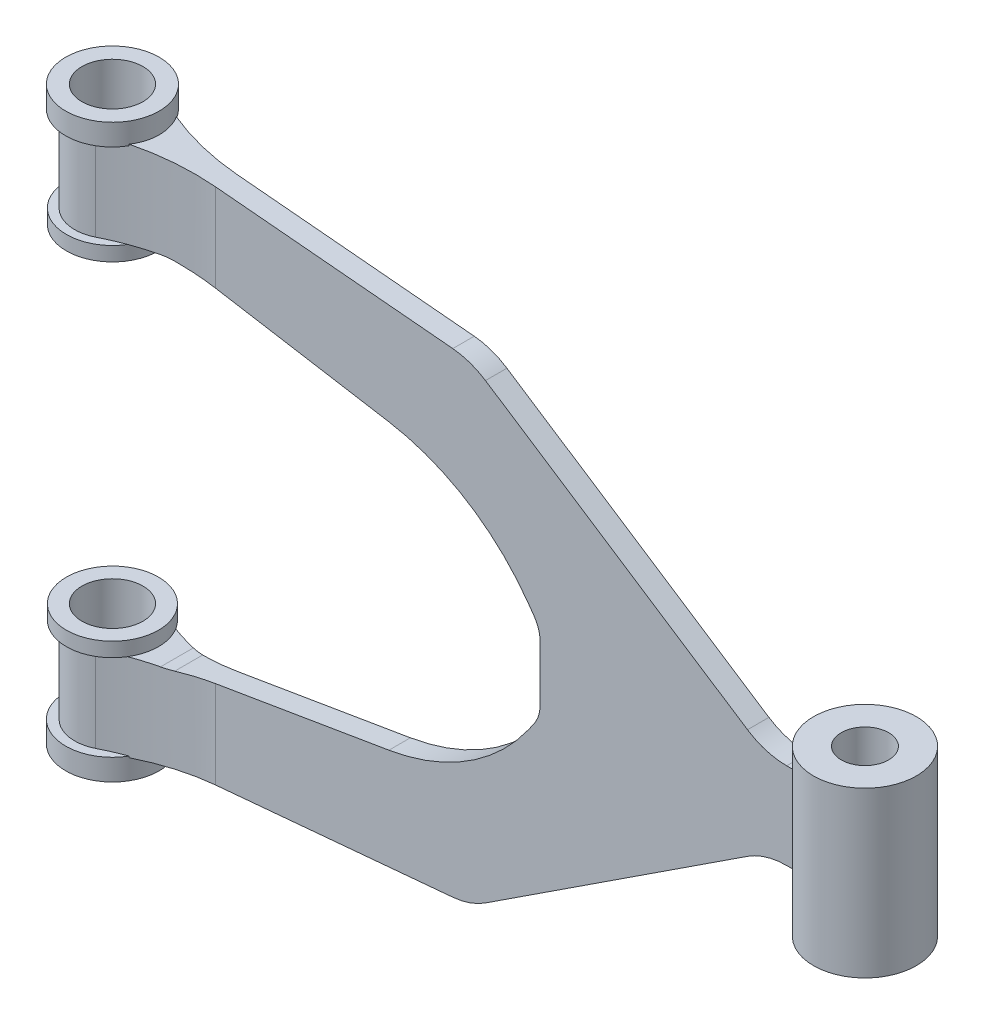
ISO-10303-21;
HEADER;
FILE_DESCRIPTION(('STEP AP214'),'2;1');
FILE_NAME('part.step','',(''),(''),'','','');
FILE_SCHEMA(('AUTOMOTIVE_DESIGN { 1 0 10303 214 1 1 1 1 }'));
ENDSEC;
DATA;
#1=APPLICATION_CONTEXT('core data for automotive mechanical design processes');
#2=APPLICATION_PROTOCOL_DEFINITION('international standard','automotive_design',2000,#1);
#3=PRODUCT_CONTEXT('',#1,'mechanical');
#4=PRODUCT('Part','Part','',(#3));
#5=PRODUCT_RELATED_PRODUCT_CATEGORY('part','',(#4));
#6=PRODUCT_DEFINITION_FORMATION('','',#4);
#7=PRODUCT_DEFINITION_CONTEXT('part definition',#1,'design');
#8=PRODUCT_DEFINITION('design','',#6,#7);
#9=PRODUCT_DEFINITION_SHAPE('','',#8);
#10=(LENGTH_UNIT() NAMED_UNIT(*) SI_UNIT(.MILLI.,.METRE.));
#11=(NAMED_UNIT(*) PLANE_ANGLE_UNIT() SI_UNIT($,.RADIAN.));
#12=(NAMED_UNIT(*) SI_UNIT($,.STERADIAN.) SOLID_ANGLE_UNIT());
#13=UNCERTAINTY_MEASURE_WITH_UNIT(LENGTH_MEASURE(1.E-05),#10,'distance_accuracy_value','');
#14=(GEOMETRIC_REPRESENTATION_CONTEXT(3) GLOBAL_UNCERTAINTY_ASSIGNED_CONTEXT((#13)) GLOBAL_UNIT_ASSIGNED_CONTEXT((#10,
#11,#12)) REPRESENTATION_CONTEXT('',''));
#15=CARTESIAN_POINT('',(0.,0.,0.));
#16=DIRECTION('',(0.,0.,1.));
#17=DIRECTION('',(1.,0.,0.));
#18=AXIS2_PLACEMENT_3D('',#15,#16,#17);
#19=CARTESIAN_POINT('',(-97.4184199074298,27.839810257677,1.5));
#20=DIRECTION('',(0.,1.,0.));
#21=DIRECTION('',(0.,0.,-1.));
#22=AXIS2_PLACEMENT_3D('',#19,#20,#21);
#23=PLANE('',#22);
#24=CARTESIAN_POINT('',(-97.4184199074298,27.839810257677,1.5));
#25=DIRECTION('',(0.,-1.,0.));
#26=DIRECTION('',(0.,0.,-1.));
#27=AXIS2_PLACEMENT_3D('',#24,#25,#26);
#28=CIRCLE('',#27,6.5401161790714);
#29=CARTESIAN_POINT('',(-97.4184199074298,27.839810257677,-5.0401161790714));
#30=VERTEX_POINT('',#29);
#31=EDGE_CURVE('E304',#30,#30,#28,.T.);
#32=ORIENTED_EDGE('',*,*,#31,.F.);
#33=EDGE_LOOP('',(#32));
#34=FACE_BOUND('',#33,.T.);
#35=CARTESIAN_POINT('',(-97.4184199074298,27.839810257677,1.5));
#36=DIRECTION('',(0.,1.,0.));
#37=DIRECTION('',(0.,0.,1.));
#38=AXIS2_PLACEMENT_3D('',#35,#36,#37);
#39=CIRCLE('',#38,4.26862712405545);
#40=CARTESIAN_POINT('',(-97.4184199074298,27.839810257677,5.76862712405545));
#41=VERTEX_POINT('',#40);
#42=EDGE_CURVE('E298',#41,#41,#39,.T.);
#43=ORIENTED_EDGE('',*,*,#42,.F.);
#44=EDGE_LOOP('',(#43));
#45=FACE_BOUND('',#44,.T.);
#46=ADVANCED_FACE('F36',(#34,#45),#23,.T.);
#47=CARTESIAN_POINT('',(-97.4184199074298,25.839810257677,1.5));
#48=DIRECTION('',(0.,-1.,0.));
#49=DIRECTION('',(0.,0.,-1.));
#50=AXIS2_PLACEMENT_3D('',#47,#48,#49);
#51=CYLINDRICAL_SURFACE('',#50,5.28501451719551);
#52=CARTESIAN_POINT('',(-97.4184199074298,12.839810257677,1.5));
#53=DIRECTION('',(0.,-1.,0.));
#54=DIRECTION('',(0.,0.,-1.));
#55=AXIS2_PLACEMENT_3D('',#52,#53,#54);
#56=CIRCLE('',#55,5.28501451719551);
#57=CARTESIAN_POINT('',(-95.0370373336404,12.839810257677,6.21809235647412));
#58=VERTEX_POINT('',#57);
#59=CARTESIAN_POINT('',(-95.0370373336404,12.839810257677,-3.21809235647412));
#60=VERTEX_POINT('',#59);
#61=EDGE_CURVE('E307',#58,#60,#56,.T.);
#62=ORIENTED_EDGE('',*,*,#61,.F.);
#63=DIRECTION('',(0.,-1.,0.));
#64=VECTOR('',#63,1.);
#65=CARTESIAN_POINT('',(-95.0370373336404,25.839810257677,6.21809235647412));
#66=LINE('',#65,#64);
#67=CARTESIAN_POINT('',(-95.0370373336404,24.839810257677,6.21809235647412));
#68=VERTEX_POINT('',#67);
#69=EDGE_CURVE('E560',#58,#68,#66,.F.);
#70=ORIENTED_EDGE('',*,*,#69,.T.);
#71=CARTESIAN_POINT('',(-97.4184199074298,24.839810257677,1.5));
#72=DIRECTION('',(0.,1.,0.));
#73=DIRECTION('',(0.,0.,1.));
#74=AXIS2_PLACEMENT_3D('',#71,#72,#73);
#75=CIRCLE('',#74,5.28501451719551);
#76=CARTESIAN_POINT('',(-95.0370373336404,24.839810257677,-3.21809235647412));
#77=VERTEX_POINT('',#76);
#78=EDGE_CURVE('E553',#68,#77,#75,.F.);
#79=ORIENTED_EDGE('',*,*,#78,.T.);
#80=DIRECTION('',(0.,-1.,0.));
#81=VECTOR('',#80,1.);
#82=CARTESIAN_POINT('',(-95.0370373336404,25.839810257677,-3.21809235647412));
#83=LINE('',#82,#81);
#84=EDGE_CURVE('E558',#77,#60,#83,.T.);
#85=ORIENTED_EDGE('',*,*,#84,.T.);
#86=EDGE_LOOP('',(#62,#70,#79,#85));
#87=FACE_BOUND('',#86,.T.);
#88=ADVANCED_FACE('F647',(#87),#51,.T.);
#89=CARTESIAN_POINT('',(-48.2915509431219,-45.3815480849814,3.));
#90=DIRECTION('',(-0.0900844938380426,0.995934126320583,0.));
#91=DIRECTION('',(-0.995934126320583,-0.0900844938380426,0.));
#92=AXIS2_PLACEMENT_3D('',#89,#90,#91);
#93=PLANE('',#92);
#94=CARTESIAN_POINT('',(-97.4184199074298,-49.8251844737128,1.5));
#95=DIRECTION('',(-0.0900844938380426,0.995934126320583,0.));
#96=DIRECTION('',(0.995934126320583,0.0900844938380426,0.));
#97=AXIS2_PLACEMENT_3D('',#94,#95,#96);
#98=ELLIPSE('',#97,6.56681602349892,6.5401161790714);
#99=CARTESIAN_POINT('',(-91.7766021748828,-49.3148693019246,-1.80802241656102));
#100=VERTEX_POINT('',#99);
#101=CARTESIAN_POINT('',(-91.7766021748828,-49.3148693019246,4.80802241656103));
#102=VERTEX_POINT('',#101);
#103=EDGE_CURVE('E394',#100,#102,#98,.F.);
#104=ORIENTED_EDGE('',*,*,#103,.F.);
#105=CARTESIAN_POINT('',(-81.5192925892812,-48.3870724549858,-30.));
#106=DIRECTION('',(-0.0900844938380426,0.995934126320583,0.));
#107=DIRECTION('',(0.995934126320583,0.0900844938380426,0.));
#108=AXIS2_PLACEMENT_3D('',#105,#106,#107);
#109=ELLIPSE('',#108,30.1224741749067,30.);
#110=CARTESIAN_POINT('',(-81.5192925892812,-48.3870724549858,0.));
#111=VERTEX_POINT('',#110);
#112=EDGE_CURVE('E1146',#100,#111,#109,.T.);
#113=ORIENTED_EDGE('',*,*,#112,.T.);
#114=DIRECTION('',(0.995934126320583,0.0900844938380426,0.));
#115=VECTOR('',#114,1.);
#116=CARTESIAN_POINT('',(-48.2915509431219,-45.3815480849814,0.));
#117=LINE('',#116,#115);
#118=CARTESIAN_POINT('',(-48.2915509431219,-45.3815480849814,0.));
#119=VERTEX_POINT('',#118);
#120=EDGE_CURVE('E441',#111,#119,#117,.T.);
#121=ORIENTED_EDGE('',*,*,#120,.T.);
#122=DIRECTION('',(0.,0.,-1.));
#123=VECTOR('',#122,1.);
#124=CARTESIAN_POINT('',(-48.2915509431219,-45.3815480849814,3.));
#125=LINE('',#124,#123);
#126=CARTESIAN_POINT('',(-48.2915509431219,-45.3815480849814,3.));
#127=VERTEX_POINT('',#126);
#128=EDGE_CURVE('E458',#127,#119,#125,.T.);
#129=ORIENTED_EDGE('',*,*,#128,.F.);
#130=DIRECTION('',(0.995934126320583,0.0900844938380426,0.));
#131=VECTOR('',#130,1.);
#132=CARTESIAN_POINT('',(-48.2915509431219,-45.3815480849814,3.));
#133=LINE('',#132,#131);
#134=CARTESIAN_POINT('',(-81.5192925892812,-48.3870724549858,3.));
#135=VERTEX_POINT('',#134);
#136=EDGE_CURVE('E421',#135,#127,#133,.T.);
#137=ORIENTED_EDGE('',*,*,#136,.F.);
#138=CARTESIAN_POINT('',(-81.5192925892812,-48.3870724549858,33.));
#139=DIRECTION('',(-0.0900844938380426,0.995934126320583,0.));
#140=DIRECTION('',(0.995934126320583,0.0900844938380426,0.));
#141=AXIS2_PLACEMENT_3D('',#138,#139,#140);
#142=ELLIPSE('',#141,30.1224741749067,30.);
#143=EDGE_CURVE('E504',#135,#102,#142,.T.);
#144=ORIENTED_EDGE('',*,*,#143,.T.);
#145=EDGE_LOOP('',(#104,#113,#121,#129,#137,#144));
#146=FACE_BOUND('',#145,.T.);
#147=ADVANCED_FACE('F674',(#146),#93,.F.);
#148=CARTESIAN_POINT('',(-1.58081857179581,-28.1800873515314,3.));
#149=DIRECTION('',(0.,0.,1.));
#150=DIRECTION('',(1.,0.,0.));
#151=AXIS2_PLACEMENT_3D('',#148,#149,#150);
#152=PLANE('',#151);
#153=DIRECTION('',(0.,1.,0.));
#154=VECTOR('',#153,1.);
#155=CARTESIAN_POINT('',(0.658622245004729,-23.,3.));
#156=LINE('',#155,#154);
#157=CARTESIAN_POINT('',(0.658622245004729,-6.09688652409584,3.));
#158=VERTEX_POINT('',#157);
#159=CARTESIAN_POINT('',(0.658622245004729,-18.1800873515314,3.));
#160=VERTEX_POINT('',#159);
#161=EDGE_CURVE('E284',#158,#160,#156,.F.);
#162=ORIENTED_EDGE('',*,*,#161,.F.);
#163=DIRECTION('',(1.,0.,0.));
#164=VECTOR('',#163,1.);
#165=CARTESIAN_POINT('',(2.54967340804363,-6.09688652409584,3.));
#166=LINE('',#165,#164);
#167=CARTESIAN_POINT('',(-1.58081857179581,-6.09688652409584,3.));
#168=VERTEX_POINT('',#167);
#169=EDGE_CURVE('E272',#168,#158,#166,.T.);
#170=ORIENTED_EDGE('',*,*,#169,.F.);
#171=CARTESIAN_POINT('',(-1.58081857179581,3.90311347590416,3.));
#172=DIRECTION('',(0.,0.,1.));
#173=DIRECTION('',(1.,0.,0.));
#174=AXIS2_PLACEMENT_3D('',#171,#172,#173);
#175=CIRCLE('',#174,10.);
#176=CARTESIAN_POINT('',(-7.05446384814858,-4.46582955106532,3.));
#177=VERTEX_POINT('',#176);
#178=EDGE_CURVE('E280',#177,#168,#175,.T.);
#179=ORIENTED_EDGE('',*,*,#178,.F.);
#180=DIRECTION('',(0.836894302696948,-0.547364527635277,0.));
#181=VECTOR('',#180,1.);
#182=CARTESIAN_POINT('',(-7.05446384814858,-4.46582955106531,3.));
#183=LINE('',#182,#181);
#184=CARTESIAN_POINT('',(-43.7187506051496,19.5141759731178,3.));
#185=VERTEX_POINT('',#184);
#186=EDGE_CURVE('E321',#185,#177,#183,.T.);
#187=ORIENTED_EDGE('',*,*,#186,.F.);
#188=CARTESIAN_POINT('',(-49.1923958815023,11.1452329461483,3.));
#189=DIRECTION('',(0.,0.,-1.));
#190=DIRECTION('',(-1.,0.,0.));
#191=AXIS2_PLACEMENT_3D('',#188,#189,#190);
#192=CIRCLE('',#191,10.);
#193=CARTESIAN_POINT('',(-48.2915509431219,21.1045742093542,3.));
#194=VERTEX_POINT('',#193);
#195=EDGE_CURVE('E324',#194,#185,#192,.T.);
#196=ORIENTED_EDGE('',*,*,#195,.F.);
#197=DIRECTION('',(0.995934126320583,-0.0900844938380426,0.));
#198=VECTOR('',#197,1.);
#199=CARTESIAN_POINT('',(-48.2915509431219,21.1045742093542,3.));
#200=LINE('',#199,#198);
#201=CARTESIAN_POINT('',(-81.5192925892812,24.1100985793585,3.));
#202=VERTEX_POINT('',#201);
#203=EDGE_CURVE('E327',#202,#194,#200,.T.);
#204=ORIENTED_EDGE('',*,*,#203,.F.);
#205=DIRECTION('',(0.,1.,0.));
#206=VECTOR('',#205,1.);
#207=CARTESIAN_POINT('',(-81.5192925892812,12.839810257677,3.));
#208=LINE('',#207,#206);
#209=CARTESIAN_POINT('',(-81.5192925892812,11.8264813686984,3.));
#210=VERTEX_POINT('',#209);
#211=EDGE_CURVE('E572',#202,#210,#208,.F.);
#212=ORIENTED_EDGE('',*,*,#211,.T.);
#213=DIRECTION('',(-0.986233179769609,0.165360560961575,0.));
#214=VECTOR('',#213,1.);
#215=CARTESIAN_POINT('',(-86.7418536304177,12.702142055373,3.));
#216=LINE('',#215,#214);
#217=CARTESIAN_POINT('',(-57.2287950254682,7.75372212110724,3.));
#218=VERTEX_POINT('',#217);
#219=EDGE_CURVE('E329',#218,#210,#216,.T.);
#220=ORIENTED_EDGE('',*,*,#219,.F.);
#221=CARTESIAN_POINT('',(-62.1896118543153,-21.833273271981,3.));
#222=DIRECTION('',(0.,0.,1.));
#223=DIRECTION('',(1.,0.,0.));
#224=AXIS2_PLACEMENT_3D('',#221,#222,#223);
#225=CIRCLE('',#224,30.);
#226=CARTESIAN_POINT('',(-37.7606195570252,-4.41993541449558,3.));
#227=VERTEX_POINT('',#226);
#228=EDGE_CURVE('E332',#227,#218,#225,.T.);
#229=ORIENTED_EDGE('',*,*,#228,.F.);
#230=DIRECTION('',(-0.580444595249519,0.814299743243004,0.));
#231=VECTOR('',#230,1.);
#232=CARTESIAN_POINT('',(-37.7606195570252,-4.41993541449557,3.));
#233=LINE('',#232,#231);
#234=CARTESIAN_POINT('',(-36.9891965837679,-5.50215675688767,3.));
#235=VERTEX_POINT('',#234);
#236=EDGE_CURVE('E335',#235,#227,#233,.T.);
#237=ORIENTED_EDGE('',*,*,#236,.F.);
#238=CARTESIAN_POINT('',(-41.0606952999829,-8.40437973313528,3.));
#239=DIRECTION('',(0.,0.,1.));
#240=DIRECTION('',(1.,0.,0.));
#241=AXIS2_PLACEMENT_3D('',#238,#239,#240);
#242=CIRCLE('',#241,5.);
#243=CARTESIAN_POINT('',(-36.0606952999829,-8.4043797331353,3.));
#244=VERTEX_POINT('',#243);
#245=EDGE_CURVE('E338',#244,#235,#242,.T.);
#246=ORIENTED_EDGE('',*,*,#245,.F.);
#247=DIRECTION('',(0.,-1.,0.));
#248=VECTOR('',#247,1.);
#249=CARTESIAN_POINT('',(-36.0606952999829,-15.872594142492,3.));
#250=LINE('',#249,#248);
#251=CARTESIAN_POINT('',(-36.0606952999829,-15.872594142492,3.));
#252=VERTEX_POINT('',#251);
#253=EDGE_CURVE('E409',#244,#252,#250,.T.);
#254=ORIENTED_EDGE('',*,*,#253,.T.);
#255=CARTESIAN_POINT('',(-41.0606952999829,-15.872594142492,3.));
#256=DIRECTION('',(0.,0.,-1.));
#257=DIRECTION('',(1.,0.,0.));
#258=AXIS2_PLACEMENT_3D('',#255,#256,#257);
#259=CIRCLE('',#258,5.);
#260=CARTESIAN_POINT('',(-36.9891965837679,-18.7748171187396,3.));
#261=VERTEX_POINT('',#260);
#262=EDGE_CURVE('E411',#252,#261,#259,.T.);
#263=ORIENTED_EDGE('',*,*,#262,.T.);
#264=DIRECTION('',(-0.580444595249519,-0.814299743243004,0.));
#265=VECTOR('',#264,1.);
#266=CARTESIAN_POINT('',(-37.7606195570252,-19.8570384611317,3.));
#267=LINE('',#266,#265);
#268=CARTESIAN_POINT('',(-37.7606195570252,-19.8570384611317,3.));
#269=VERTEX_POINT('',#268);
#270=EDGE_CURVE('E414',#261,#269,#267,.T.);
#271=ORIENTED_EDGE('',*,*,#270,.T.);
#272=CARTESIAN_POINT('',(-62.1896118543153,-2.44370060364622,3.));
#273=DIRECTION('',(0.,0.,-1.));
#274=DIRECTION('',(1.,0.,0.));
#275=AXIS2_PLACEMENT_3D('',#272,#273,#274);
#276=CIRCLE('',#275,30.);
#277=CARTESIAN_POINT('',(-57.2287950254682,-32.0306959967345,3.));
#278=VERTEX_POINT('',#277);
#279=EDGE_CURVE('E416',#269,#278,#276,.T.);
#280=ORIENTED_EDGE('',*,*,#279,.T.);
#281=DIRECTION('',(-0.986233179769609,-0.165360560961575,0.));
#282=VECTOR('',#281,1.);
#283=CARTESIAN_POINT('',(-86.7418536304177,-36.9791159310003,3.));
#284=LINE('',#283,#282);
#285=CARTESIAN_POINT('',(-81.5192925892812,-36.1034552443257,3.));
#286=VERTEX_POINT('',#285);
#287=EDGE_CURVE('E418',#278,#286,#284,.T.);
#288=ORIENTED_EDGE('',*,*,#287,.T.);
#289=DIRECTION('',(0.,1.,0.));
#290=VECTOR('',#289,1.);
#291=CARTESIAN_POINT('',(-81.5192925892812,-28.1800873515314,3.));
#292=LINE('',#291,#290);
#293=EDGE_CURVE('E480',#286,#135,#292,.F.);
#294=ORIENTED_EDGE('',*,*,#293,.T.);
#295=ORIENTED_EDGE('',*,*,#136,.T.);
#296=CARTESIAN_POINT('',(-49.1923958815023,-35.4222068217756,3.));
#297=DIRECTION('',(0.,0.,1.));
#298=DIRECTION('',(-1.,0.,0.));
#299=AXIS2_PLACEMENT_3D('',#296,#297,#298);
#300=CIRCLE('',#299,10.);
#301=CARTESIAN_POINT('',(-43.7187506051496,-43.7911498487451,3.));
#302=VERTEX_POINT('',#301);
#303=EDGE_CURVE('E423',#127,#302,#300,.T.);
#304=ORIENTED_EDGE('',*,*,#303,.T.);
#305=DIRECTION('',(0.836894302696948,0.547364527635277,0.));
#306=VECTOR('',#305,1.);
#307=CARTESIAN_POINT('',(-7.05446384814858,-19.811144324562,3.));
#308=LINE('',#307,#306);
#309=CARTESIAN_POINT('',(-7.05446384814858,-19.811144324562,3.));
#310=VERTEX_POINT('',#309);
#311=EDGE_CURVE('E425',#302,#310,#308,.T.);
#312=ORIENTED_EDGE('',*,*,#311,.T.);
#313=CARTESIAN_POINT('',(-1.58081857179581,-28.1800873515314,3.));
#314=DIRECTION('',(0.,0.,-1.));
#315=DIRECTION('',(1.,0.,0.));
#316=AXIS2_PLACEMENT_3D('',#313,#314,#315);
#317=CIRCLE('',#316,10.);
#318=CARTESIAN_POINT('',(-1.58081857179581,-18.1800873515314,3.));
#319=VERTEX_POINT('',#318);
#320=EDGE_CURVE('E427',#310,#319,#317,.T.);
#321=ORIENTED_EDGE('',*,*,#320,.T.);
#322=DIRECTION('',(1.,0.,0.));
#323=VECTOR('',#322,1.);
#324=CARTESIAN_POINT('',(2.54967340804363,-18.1800873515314,3.));
#325=LINE('',#324,#323);
#326=EDGE_CURVE('E286',#319,#160,#325,.T.);
#327=ORIENTED_EDGE('',*,*,#326,.T.);
#328=EDGE_LOOP('',(#162,#170,#179,#187,#196,#204,#212,#220,#229,#237,#246,#254,#263,#271,#280,
#288,#294,#295,#304,#312,#321,#327));
#329=FACE_BOUND('',#328,.T.);
#330=ADVANCED_FACE('F285',(#329),#152,.T.);
#331=CARTESIAN_POINT('',(-1.58081857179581,-28.1800873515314,0.));
#332=DIRECTION('',(0.,0.,1.));
#333=DIRECTION('',(1.,0.,0.));
#334=AXIS2_PLACEMENT_3D('',#331,#332,#333);
#335=PLANE('',#334);
#336=DIRECTION('',(1.,0.,0.));
#337=VECTOR('',#336,1.);
#338=CARTESIAN_POINT('',(2.54967340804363,-6.09688652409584,0.));
#339=LINE('',#338,#337);
#340=CARTESIAN_POINT('',(-1.58081857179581,-6.09688652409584,0.));
#341=VERTEX_POINT('',#340);
#342=CARTESIAN_POINT('',(0.553603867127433,-6.09688652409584,0.));
#343=VERTEX_POINT('',#342);
#344=EDGE_CURVE('E317',#341,#343,#339,.T.);
#345=ORIENTED_EDGE('',*,*,#344,.T.);
#346=DIRECTION('',(0.,1.,0.));
#347=VECTOR('',#346,1.);
#348=CARTESIAN_POINT('',(0.553603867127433,-23.,0.));
#349=LINE('',#348,#347);
#350=CARTESIAN_POINT('',(0.553603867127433,-18.1800873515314,0.));
#351=VERTEX_POINT('',#350);
#352=EDGE_CURVE('E60',#343,#351,#349,.F.);
#353=ORIENTED_EDGE('',*,*,#352,.T.);
#354=DIRECTION('',(1.,0.,0.));
#355=VECTOR('',#354,1.);
#356=CARTESIAN_POINT('',(2.54967340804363,-18.1800873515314,0.));
#357=LINE('',#356,#355);
#358=CARTESIAN_POINT('',(-1.58081857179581,-18.1800873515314,0.));
#359=VERTEX_POINT('',#358);
#360=EDGE_CURVE('E412',#359,#351,#357,.T.);
#361=ORIENTED_EDGE('',*,*,#360,.F.);
#362=CARTESIAN_POINT('',(-1.58081857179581,-28.1800873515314,0.));
#363=DIRECTION('',(0.,0.,-1.));
#364=DIRECTION('',(1.,0.,0.));
#365=AXIS2_PLACEMENT_3D('',#362,#363,#364);
#366=CIRCLE('',#365,10.);
#367=CARTESIAN_POINT('',(-7.05446384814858,-19.811144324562,0.));
#368=VERTEX_POINT('',#367);
#369=EDGE_CURVE('E447',#368,#359,#366,.T.);
#370=ORIENTED_EDGE('',*,*,#369,.F.);
#371=DIRECTION('',(0.836894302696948,0.547364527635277,0.));
#372=VECTOR('',#371,1.);
#373=CARTESIAN_POINT('',(-7.05446384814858,-19.811144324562,0.));
#374=LINE('',#373,#372);
#375=CARTESIAN_POINT('',(-43.7187506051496,-43.7911498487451,0.));
#376=VERTEX_POINT('',#375);
#377=EDGE_CURVE('E445',#376,#368,#374,.T.);
#378=ORIENTED_EDGE('',*,*,#377,.F.);
#379=CARTESIAN_POINT('',(-49.1923958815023,-35.4222068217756,0.));
#380=DIRECTION('',(0.,0.,1.));
#381=DIRECTION('',(-1.,0.,0.));
#382=AXIS2_PLACEMENT_3D('',#379,#380,#381);
#383=CIRCLE('',#382,10.);
#384=EDGE_CURVE('E443',#119,#376,#383,.T.);
#385=ORIENTED_EDGE('',*,*,#384,.F.);
#386=ORIENTED_EDGE('',*,*,#120,.F.);
#387=DIRECTION('',(0.,-1.,0.));
#388=VECTOR('',#387,1.);
#389=CARTESIAN_POINT('',(-81.5192925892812,-37.1167841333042,0.));
#390=LINE('',#389,#388);
#391=CARTESIAN_POINT('',(-81.5192925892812,-36.1034552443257,0.));
#392=VERTEX_POINT('',#391);
#393=EDGE_CURVE('E502',#111,#392,#390,.F.);
#394=ORIENTED_EDGE('',*,*,#393,.T.);
#395=DIRECTION('',(-0.986233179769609,-0.165360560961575,0.));
#396=VECTOR('',#395,1.);
#397=CARTESIAN_POINT('',(-86.7418536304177,-36.9791159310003,0.));
#398=LINE('',#397,#396);
#399=CARTESIAN_POINT('',(-57.2287950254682,-32.0306959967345,0.));
#400=VERTEX_POINT('',#399);
#401=EDGE_CURVE('E438',#400,#392,#398,.T.);
#402=ORIENTED_EDGE('',*,*,#401,.F.);
#403=CARTESIAN_POINT('',(-62.1896118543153,-2.44370060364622,0.));
#404=DIRECTION('',(0.,0.,-1.));
#405=DIRECTION('',(1.,0.,0.));
#406=AXIS2_PLACEMENT_3D('',#403,#404,#405);
#407=CIRCLE('',#406,30.);
#408=CARTESIAN_POINT('',(-37.7606195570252,-19.8570384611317,0.));
#409=VERTEX_POINT('',#408);
#410=EDGE_CURVE('E436',#409,#400,#407,.T.);
#411=ORIENTED_EDGE('',*,*,#410,.F.);
#412=DIRECTION('',(-0.580444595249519,-0.814299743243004,0.));
#413=VECTOR('',#412,1.);
#414=CARTESIAN_POINT('',(-37.7606195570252,-19.8570384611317,0.));
#415=LINE('',#414,#413);
#416=CARTESIAN_POINT('',(-36.9891965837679,-18.7748171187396,0.));
#417=VERTEX_POINT('',#416);
#418=EDGE_CURVE('E434',#417,#409,#415,.T.);
#419=ORIENTED_EDGE('',*,*,#418,.F.);
#420=CARTESIAN_POINT('',(-41.0606952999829,-15.872594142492,0.));
#421=DIRECTION('',(0.,0.,-1.));
#422=DIRECTION('',(1.,0.,0.));
#423=AXIS2_PLACEMENT_3D('',#420,#421,#422);
#424=CIRCLE('',#423,5.);
#425=CARTESIAN_POINT('',(-36.0606952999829,-15.872594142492,0.));
#426=VERTEX_POINT('',#425);
#427=EDGE_CURVE('E432',#426,#417,#424,.T.);
#428=ORIENTED_EDGE('',*,*,#427,.F.);
#429=DIRECTION('',(0.,-1.,0.));
#430=VECTOR('',#429,1.);
#431=CARTESIAN_POINT('',(-36.0606952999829,-15.872594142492,0.));
#432=LINE('',#431,#430);
#433=CARTESIAN_POINT('',(-36.0606952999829,-8.4043797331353,0.));
#434=VERTEX_POINT('',#433);
#435=EDGE_CURVE('E406',#434,#426,#432,.T.);
#436=ORIENTED_EDGE('',*,*,#435,.F.);
#437=CARTESIAN_POINT('',(-41.0606952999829,-8.40437973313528,0.));
#438=DIRECTION('',(0.,0.,1.));
#439=DIRECTION('',(1.,0.,0.));
#440=AXIS2_PLACEMENT_3D('',#437,#438,#439);
#441=CIRCLE('',#440,5.);
#442=CARTESIAN_POINT('',(-36.9891965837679,-5.50215675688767,0.));
#443=VERTEX_POINT('',#442);
#444=EDGE_CURVE('E281',#434,#443,#441,.T.);
#445=ORIENTED_EDGE('',*,*,#444,.T.);
#446=DIRECTION('',(-0.580444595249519,0.814299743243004,0.));
#447=VECTOR('',#446,1.);
#448=CARTESIAN_POINT('',(-37.7606195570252,-4.41993541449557,0.));
#449=LINE('',#448,#447);
#450=CARTESIAN_POINT('',(-37.7606195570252,-4.41993541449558,0.));
#451=VERTEX_POINT('',#450);
#452=EDGE_CURVE('E360',#443,#451,#449,.T.);
#453=ORIENTED_EDGE('',*,*,#452,.T.);
#454=CARTESIAN_POINT('',(-62.1896118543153,-21.833273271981,0.));
#455=DIRECTION('',(0.,0.,1.));
#456=DIRECTION('',(1.,0.,0.));
#457=AXIS2_PLACEMENT_3D('',#454,#455,#456);
#458=CIRCLE('',#457,30.);
#459=CARTESIAN_POINT('',(-57.2287950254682,7.75372212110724,0.));
#460=VERTEX_POINT('',#459);
#461=EDGE_CURVE('E357',#451,#460,#458,.T.);
#462=ORIENTED_EDGE('',*,*,#461,.T.);
#463=DIRECTION('',(-0.986233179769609,0.165360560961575,0.));
#464=VECTOR('',#463,1.);
#465=CARTESIAN_POINT('',(-86.7418536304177,12.702142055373,0.));
#466=LINE('',#465,#464);
#467=CARTESIAN_POINT('',(-81.5192925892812,11.8264813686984,0.));
#468=VERTEX_POINT('',#467);
#469=EDGE_CURVE('E354',#460,#468,#466,.T.);
#470=ORIENTED_EDGE('',*,*,#469,.T.);
#471=DIRECTION('',(0.,-1.,0.));
#472=VECTOR('',#471,1.);
#473=CARTESIAN_POINT('',(-81.5192925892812,-28.1800873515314,0.));
#474=LINE('',#473,#472);
#475=CARTESIAN_POINT('',(-81.5192925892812,24.1100985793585,0.));
#476=VERTEX_POINT('',#475);
#477=EDGE_CURVE('E579',#468,#476,#474,.F.);
#478=ORIENTED_EDGE('',*,*,#477,.T.);
#479=DIRECTION('',(0.995934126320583,-0.0900844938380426,0.));
#480=VECTOR('',#479,1.);
#481=CARTESIAN_POINT('',(-48.2915509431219,21.1045742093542,0.));
#482=LINE('',#481,#480);
#483=CARTESIAN_POINT('',(-48.2915509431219,21.1045742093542,0.));
#484=VERTEX_POINT('',#483);
#485=EDGE_CURVE('E352',#476,#484,#482,.T.);
#486=ORIENTED_EDGE('',*,*,#485,.T.);
#487=CARTESIAN_POINT('',(-49.1923958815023,11.1452329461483,0.));
#488=DIRECTION('',(0.,0.,-1.));
#489=DIRECTION('',(-1.,0.,0.));
#490=AXIS2_PLACEMENT_3D('',#487,#488,#489);
#491=CIRCLE('',#490,10.);
#492=CARTESIAN_POINT('',(-43.7187506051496,19.5141759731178,0.));
#493=VERTEX_POINT('',#492);
#494=EDGE_CURVE('E349',#484,#493,#491,.T.);
#495=ORIENTED_EDGE('',*,*,#494,.T.);
#496=DIRECTION('',(0.836894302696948,-0.547364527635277,0.));
#497=VECTOR('',#496,1.);
#498=CARTESIAN_POINT('',(-7.05446384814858,-4.46582955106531,0.));
#499=LINE('',#498,#497);
#500=CARTESIAN_POINT('',(-7.05446384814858,-4.46582955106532,0.));
#501=VERTEX_POINT('',#500);
#502=EDGE_CURVE('E346',#493,#501,#499,.T.);
#503=ORIENTED_EDGE('',*,*,#502,.T.);
#504=CARTESIAN_POINT('',(-1.58081857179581,3.90311347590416,0.));
#505=DIRECTION('',(0.,0.,1.));
#506=DIRECTION('',(1.,0.,0.));
#507=AXIS2_PLACEMENT_3D('',#504,#505,#506);
#508=CIRCLE('',#507,10.);
#509=EDGE_CURVE('E343',#501,#341,#508,.T.);
#510=ORIENTED_EDGE('',*,*,#509,.T.);
#511=EDGE_LOOP('',(#345,#353,#361,#370,#378,#385,#386,#394,#402,#411,#419,#428,#436,#445,#453,
#462,#470,#478,#486,#495,#503,#510));
#512=FACE_BOUND('',#511,.T.);
#513=ADVANCED_FACE('F623',(#512),#335,.F.);
#514=CARTESIAN_POINT('',(-97.4184199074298,-50.1167841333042,1.5));
#515=DIRECTION('',(0.,1.,0.));
#516=DIRECTION('',(0.,0.,1.));
#517=AXIS2_PLACEMENT_3D('',#514,#515,#516);
#518=CYLINDRICAL_SURFACE('',#517,5.28501451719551);
#519=CARTESIAN_POINT('',(-97.4184199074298,-49.1167841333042,1.5));
#520=DIRECTION('',(0.,-1.,0.));
#521=DIRECTION('',(0.,0.,-1.));
#522=AXIS2_PLACEMENT_3D('',#519,#520,#521);
#523=CIRCLE('',#522,5.28501451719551);
#524=CARTESIAN_POINT('',(-95.0370373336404,-49.1167841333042,6.21809235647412));
#525=VERTEX_POINT('',#524);
#526=CARTESIAN_POINT('',(-95.0370373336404,-49.1167841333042,-3.21809235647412));
#527=VERTEX_POINT('',#526);
#528=EDGE_CURVE('E477',#525,#527,#523,.T.);
#529=ORIENTED_EDGE('',*,*,#528,.F.);
#530=DIRECTION('',(0.,1.,0.));
#531=VECTOR('',#530,1.);
#532=CARTESIAN_POINT('',(-95.0370373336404,-50.1167841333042,6.21809235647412));
#533=LINE('',#532,#531);
#534=CARTESIAN_POINT('',(-95.0370373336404,-37.1167841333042,6.21809235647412));
#535=VERTEX_POINT('',#534);
#536=EDGE_CURVE('E495',#525,#535,#533,.T.);
#537=ORIENTED_EDGE('',*,*,#536,.T.);
#538=CARTESIAN_POINT('',(-97.4184199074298,-37.1167841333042,1.5));
#539=DIRECTION('',(0.,-1.,0.));
#540=DIRECTION('',(0.,0.,-1.));
#541=AXIS2_PLACEMENT_3D('',#538,#539,#540);
#542=CIRCLE('',#541,5.28501451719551);
#543=CARTESIAN_POINT('',(-95.0370373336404,-37.1167841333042,-3.21809235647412));
#544=VERTEX_POINT('',#543);
#545=EDGE_CURVE('E396',#535,#544,#542,.T.);
#546=ORIENTED_EDGE('',*,*,#545,.T.);
#547=DIRECTION('',(0.,1.,0.));
#548=VECTOR('',#547,1.);
#549=CARTESIAN_POINT('',(-95.0370373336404,-50.1167841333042,-3.21809235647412));
#550=LINE('',#549,#548);
#551=EDGE_CURVE('E492',#544,#527,#550,.F.);
#552=ORIENTED_EDGE('',*,*,#551,.T.);
#553=EDGE_LOOP('',(#529,#537,#546,#552));
#554=FACE_BOUND('',#553,.T.);
#555=ADVANCED_FACE('F1097',(#554),#518,.T.);
#556=CARTESIAN_POINT('',(-97.4184199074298,-37.1167841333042,1.5));
#557=DIRECTION('',(0.,1.,0.));
#558=DIRECTION('',(0.,0.,1.));
#559=AXIS2_PLACEMENT_3D('',#556,#557,#558);
#560=PLANE('',#559);
#561=ORIENTED_EDGE('',*,*,#545,.F.);
#562=CARTESIAN_POINT('',(-81.5192925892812,-37.1167841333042,33.));
#563=DIRECTION('',(0.,1.,0.));
#564=DIRECTION('',(0.,0.,1.));
#565=AXIS2_PLACEMENT_3D('',#562,#563,#564);
#566=CIRCLE('',#565,30.);
#567=CARTESIAN_POINT('',(-91.9222430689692,-37.1167841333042,4.86143889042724));
#568=VERTEX_POINT('',#567);
#569=EDGE_CURVE('E499',#535,#568,#566,.F.);
#570=ORIENTED_EDGE('',*,*,#569,.T.);
#571=CARTESIAN_POINT('',(-97.4184199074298,-37.1167841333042,1.5));
#572=DIRECTION('',(0.,1.,0.));
#573=DIRECTION('',(0.,0.,1.));
#574=AXIS2_PLACEMENT_3D('',#571,#572,#573);
#575=CIRCLE('',#574,6.44261059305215);
#576=CARTESIAN_POINT('',(-91.9222430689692,-37.1167841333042,-1.86143889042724));
#577=VERTEX_POINT('',#576);
#578=EDGE_CURVE('E402',#577,#568,#575,.T.);
#579=ORIENTED_EDGE('',*,*,#578,.F.);
#580=CARTESIAN_POINT('',(-81.5192925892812,-37.1167841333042,-30.));
#581=DIRECTION('',(0.,1.,0.));
#582=DIRECTION('',(0.,0.,1.));
#583=AXIS2_PLACEMENT_3D('',#580,#581,#582);
#584=CIRCLE('',#583,30.);
#585=EDGE_CURVE('E497',#577,#544,#584,.F.);
#586=ORIENTED_EDGE('',*,*,#585,.T.);
#587=EDGE_LOOP('',(#561,#570,#579,#586));
#588=FACE_BOUND('',#587,.T.);
#589=ADVANCED_FACE('F1079',(#588),#560,.F.);
#590=CARTESIAN_POINT('',(-97.4184199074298,-37.1167841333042,3.));
#591=DIRECTION('',(0.,-1.,0.));
#592=DIRECTION('',(0.,0.,-1.));
#593=AXIS2_PLACEMENT_3D('',#590,#591,#592);
#594=PLANE('',#593);
#595=EDGE_CURVE('E407',#568,#577,#575,.T.);
#596=ORIENTED_EDGE('',*,*,#595,.F.);
#597=CARTESIAN_POINT('',(-81.5192925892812,-37.1167841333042,33.));
#598=DIRECTION('',(0.,-1.,0.));
#599=DIRECTION('',(0.,0.,-1.));
#600=AXIS2_PLACEMENT_3D('',#597,#598,#599);
#601=CIRCLE('',#600,30.);
#602=CARTESIAN_POINT('',(-88.3954592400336,-37.1167841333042,3.79865872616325));
#603=VERTEX_POINT('',#602);
#604=EDGE_CURVE('E507',#568,#603,#601,.T.);
#605=ORIENTED_EDGE('',*,*,#604,.T.);
#606=DIRECTION('',(0.,0.,-1.));
#607=VECTOR('',#606,1.);
#608=CARTESIAN_POINT('',(-88.3954592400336,-37.1167841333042,3.));
#609=LINE('',#608,#607);
#610=CARTESIAN_POINT('',(-88.3954592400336,-37.1167841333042,-0.798658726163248));
#611=VERTEX_POINT('',#610);
#612=EDGE_CURVE('E461',#603,#611,#609,.T.);
#613=ORIENTED_EDGE('',*,*,#612,.T.);
#614=CARTESIAN_POINT('',(-81.5192925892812,-37.1167841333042,-30.));
#615=DIRECTION('',(0.,-1.,0.));
#616=DIRECTION('',(0.,0.,-1.));
#617=AXIS2_PLACEMENT_3D('',#614,#615,#616);
#618=CIRCLE('',#617,30.);
#619=EDGE_CURVE('E549',#611,#577,#618,.T.);
#620=ORIENTED_EDGE('',*,*,#619,.T.);
#621=EDGE_LOOP('',(#596,#605,#613,#620));
#622=FACE_BOUND('',#621,.T.);
#623=ADVANCED_FACE('F804',(#622),#594,.F.);
#624=CARTESIAN_POINT('',(-36.0606952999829,-15.872594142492,3.));
#625=DIRECTION('',(1.,0.,0.));
#626=DIRECTION('',(0.,0.,-1.));
#627=AXIS2_PLACEMENT_3D('',#624,#625,#626);
#628=PLANE('',#627);
#629=ORIENTED_EDGE('',*,*,#435,.T.);
#630=DIRECTION('',(0.,0.,-1.));
#631=VECTOR('',#630,1.);
#632=CARTESIAN_POINT('',(-36.0606952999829,-15.872594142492,3.));
#633=LINE('',#632,#631);
#634=EDGE_CURVE('E474',#252,#426,#633,.T.);
#635=ORIENTED_EDGE('',*,*,#634,.F.);
#636=ORIENTED_EDGE('',*,*,#253,.F.);
#637=DIRECTION('',(0.,0.,-1.));
#638=VECTOR('',#637,1.);
#639=CARTESIAN_POINT('',(-36.0606952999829,-8.4043797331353,3.));
#640=LINE('',#639,#638);
#641=EDGE_CURVE('E341',#244,#434,#640,.T.);
#642=ORIENTED_EDGE('',*,*,#641,.T.);
#643=EDGE_LOOP('',(#629,#635,#636,#642));
#644=FACE_BOUND('',#643,.T.);
#645=ADVANCED_FACE('F533',(#644),#628,.F.);
#646=CARTESIAN_POINT('',(-41.0606952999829,-15.872594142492,3.));
#647=DIRECTION('',(0.,0.,-1.));
#648=DIRECTION('',(-1.,0.,0.));
#649=AXIS2_PLACEMENT_3D('',#646,#647,#648);
#650=CYLINDRICAL_SURFACE('',#649,5.);
#651=ORIENTED_EDGE('',*,*,#427,.T.);
#652=DIRECTION('',(0.,0.,-1.));
#653=VECTOR('',#652,1.);
#654=CARTESIAN_POINT('',(-36.9891965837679,-18.7748171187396,3.));
#655=LINE('',#654,#653);
#656=EDGE_CURVE('E471',#261,#417,#655,.T.);
#657=ORIENTED_EDGE('',*,*,#656,.F.);
#658=ORIENTED_EDGE('',*,*,#262,.F.);
#659=ORIENTED_EDGE('',*,*,#634,.T.);
#660=EDGE_LOOP('',(#651,#657,#658,#659));
#661=FACE_BOUND('',#660,.T.);
#662=ADVANCED_FACE('F803',(#661),#650,.F.);
#663=CARTESIAN_POINT('',(-37.7606195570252,-19.8570384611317,3.));
#664=DIRECTION('',(0.814299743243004,-0.580444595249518,0.));
#665=DIRECTION('',(0.580444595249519,0.814299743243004,0.));
#666=AXIS2_PLACEMENT_3D('',#663,#664,#665);
#667=PLANE('',#666);
#668=ORIENTED_EDGE('',*,*,#418,.T.);
#669=DIRECTION('',(0.,0.,-1.));
#670=VECTOR('',#669,1.);
#671=CARTESIAN_POINT('',(-37.7606195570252,-19.8570384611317,3.));
#672=LINE('',#671,#670);
#673=EDGE_CURVE('E468',#269,#409,#672,.T.);
#674=ORIENTED_EDGE('',*,*,#673,.F.);
#675=ORIENTED_EDGE('',*,*,#270,.F.);
#676=ORIENTED_EDGE('',*,*,#656,.T.);
#677=EDGE_LOOP('',(#668,#674,#675,#676));
#678=FACE_BOUND('',#677,.T.);
#679=ADVANCED_FACE('F1040',(#678),#667,.F.);
#680=CARTESIAN_POINT('',(-62.1896118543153,-2.44370060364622,3.));
#681=DIRECTION('',(0.,0.,-1.));
#682=DIRECTION('',(-1.,0.,0.));
#683=AXIS2_PLACEMENT_3D('',#680,#681,#682);
#684=CYLINDRICAL_SURFACE('',#683,30.);
#685=ORIENTED_EDGE('',*,*,#410,.T.);
#686=DIRECTION('',(0.,0.,-1.));
#687=VECTOR('',#686,1.);
#688=CARTESIAN_POINT('',(-57.2287950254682,-32.0306959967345,3.));
#689=LINE('',#688,#687);
#690=EDGE_CURVE('E465',#278,#400,#689,.T.);
#691=ORIENTED_EDGE('',*,*,#690,.F.);
#692=ORIENTED_EDGE('',*,*,#279,.F.);
#693=ORIENTED_EDGE('',*,*,#673,.T.);
#694=EDGE_LOOP('',(#685,#691,#692,#693));
#695=FACE_BOUND('',#694,.T.);
#696=ADVANCED_FACE('F1033',(#695),#684,.F.);
#697=CARTESIAN_POINT('',(-86.7418536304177,-36.9791159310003,3.));
#698=DIRECTION('',(0.165360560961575,-0.986233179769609,0.));
#699=DIRECTION('',(0.986233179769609,0.165360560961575,0.));
#700=AXIS2_PLACEMENT_3D('',#697,#698,#699);
#701=PLANE('',#700);
#702=ORIENTED_EDGE('',*,*,#401,.T.);
#703=CARTESIAN_POINT('',(-81.5192925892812,-36.1034552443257,-30.));
#704=DIRECTION('',(0.165360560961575,-0.986233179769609,0.));
#705=DIRECTION('',(0.986233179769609,0.165360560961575,0.));
#706=AXIS2_PLACEMENT_3D('',#703,#704,#705);
#707=ELLIPSE('',#706,30.4187697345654,30.);
#708=CARTESIAN_POINT('',(-86.7418536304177,-36.9791159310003,-0.45808306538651));
#709=VERTEX_POINT('',#708);
#710=EDGE_CURVE('E550',#392,#709,#707,.T.);
#711=ORIENTED_EDGE('',*,*,#710,.T.);
#712=DIRECTION('',(0.,0.,-1.));
#713=VECTOR('',#712,1.);
#714=CARTESIAN_POINT('',(-86.7418536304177,-36.9791159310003,3.));
#715=LINE('',#714,#713);
#716=CARTESIAN_POINT('',(-86.7418536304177,-36.9791159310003,3.45808306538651));
#717=VERTEX_POINT('',#716);
#718=EDGE_CURVE('E463',#717,#709,#715,.T.);
#719=ORIENTED_EDGE('',*,*,#718,.F.);
#720=CARTESIAN_POINT('',(-81.5192925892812,-36.1034552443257,33.));
#721=DIRECTION('',(0.165360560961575,-0.986233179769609,0.));
#722=DIRECTION('',(0.986233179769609,0.165360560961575,0.));
#723=AXIS2_PLACEMENT_3D('',#720,#721,#722);
#724=ELLIPSE('',#723,30.4187697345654,30.);
#725=EDGE_CURVE('E519',#717,#286,#724,.T.);
#726=ORIENTED_EDGE('',*,*,#725,.T.);
#727=ORIENTED_EDGE('',*,*,#287,.F.);
#728=ORIENTED_EDGE('',*,*,#690,.T.);
#729=EDGE_LOOP('',(#702,#711,#719,#726,#727,#728));
#730=FACE_BOUND('',#729,.T.);
#731=ADVANCED_FACE('F1026',(#730),#701,.F.);
#732=CARTESIAN_POINT('',(-88.3954592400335,-27.1167841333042,3.));
#733=DIRECTION('',(0.,0.,-1.));
#734=DIRECTION('',(-1.,0.,0.));
#735=AXIS2_PLACEMENT_3D('',#732,#733,#734);
#736=CYLINDRICAL_SURFACE('',#735,10.);
#737=ORIENTED_EDGE('',*,*,#718,.T.);
#738=CARTESIAN_POINT('',(-86.7418536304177,-36.9791159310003,-0.45808306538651));
#739=CARTESIAN_POINT('',(-86.8793023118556,-37.0021642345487,-0.482379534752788));
#740=CARTESIAN_POINT('',(-87.017051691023,-37.0223039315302,-0.50772311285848));
#741=CARTESIAN_POINT('',(-87.2926222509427,-37.0567531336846,-0.560430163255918));
#742=CARTESIAN_POINT('',(-87.4304428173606,-37.0710734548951,-0.587789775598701));
#743=CARTESIAN_POINT('',(-87.7061405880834,-37.0939567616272,-0.644545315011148));
#744=CARTESIAN_POINT('',(-87.844017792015,-37.1025197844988,-0.673941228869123));
#745=CARTESIAN_POINT('',(-88.1198274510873,-37.1139399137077,-0.73478252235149));
#746=CARTESIAN_POINT('',(-88.2577595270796,-37.116786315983,-0.766231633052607));
#747=CARTESIAN_POINT('',(-88.3954592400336,-37.1167841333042,-0.798658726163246));
#748=B_SPLINE_CURVE_WITH_KNOTS('',3,(#738,#739,#740,#741,#742,#743,#744,#745,#746,#747),
.UNSPECIFIED.,.F.,.F.,(4,2,2,2,4),(0.,0.424372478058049,0.847952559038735,1.2715298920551,
1.69589961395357),.UNSPECIFIED.);
#749=EDGE_CURVE('E541',#709,#611,#748,.T.);
#750=ORIENTED_EDGE('',*,*,#749,.T.);
#751=ORIENTED_EDGE('',*,*,#612,.F.);
#752=CARTESIAN_POINT('',(-88.3954592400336,-37.1167841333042,3.79865872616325));
#753=CARTESIAN_POINT('',(-88.2577595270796,-37.116786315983,3.76623163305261));
#754=CARTESIAN_POINT('',(-88.1198274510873,-37.1139399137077,3.73478252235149));
#755=CARTESIAN_POINT('',(-87.844017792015,-37.1025197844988,3.67394122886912));
#756=CARTESIAN_POINT('',(-87.7061405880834,-37.0939567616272,3.64454531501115));
#757=CARTESIAN_POINT('',(-87.4304428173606,-37.0710734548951,3.5877897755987));
#758=CARTESIAN_POINT('',(-87.2926222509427,-37.0567531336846,3.56043016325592));
#759=CARTESIAN_POINT('',(-87.017051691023,-37.0223039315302,3.50772311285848));
#760=CARTESIAN_POINT('',(-86.8793023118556,-37.0021642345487,3.48237953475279));
#761=CARTESIAN_POINT('',(-86.7418536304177,-36.9791159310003,3.45808306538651));
#762=B_SPLINE_CURVE_WITH_KNOTS('',3,(#752,#753,#754,#755,#756,#757,#758,#759,#760,#761),
.UNSPECIFIED.,.F.,.F.,(4,2,2,2,4),(0.,0.424369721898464,0.847947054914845,1.27152713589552,
1.69589961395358),.UNSPECIFIED.);
#763=EDGE_CURVE('E510',#603,#717,#762,.T.);
#764=ORIENTED_EDGE('',*,*,#763,.T.);
#765=EDGE_LOOP('',(#737,#750,#751,#764));
#766=FACE_BOUND('',#765,.T.);
#767=ADVANCED_FACE('F521',(#766),#736,.F.);
#768=CARTESIAN_POINT('',(-49.1923958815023,-35.4222068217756,3.));
#769=DIRECTION('',(0.,0.,-1.));
#770=DIRECTION('',(-1.,0.,0.));
#771=AXIS2_PLACEMENT_3D('',#768,#769,#770);
#772=CYLINDRICAL_SURFACE('',#771,10.);
#773=ORIENTED_EDGE('',*,*,#384,.T.);
#774=DIRECTION('',(0.,0.,-1.));
#775=VECTOR('',#774,1.);
#776=CARTESIAN_POINT('',(-43.7187506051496,-43.7911498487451,3.));
#777=LINE('',#776,#775);
#778=EDGE_CURVE('E455',#302,#376,#777,.T.);
#779=ORIENTED_EDGE('',*,*,#778,.F.);
#780=ORIENTED_EDGE('',*,*,#303,.F.);
#781=ORIENTED_EDGE('',*,*,#128,.T.);
#782=EDGE_LOOP('',(#773,#779,#780,#781));
#783=FACE_BOUND('',#782,.T.);
#784=ADVANCED_FACE('F1011',(#783),#772,.T.);
#785=CARTESIAN_POINT('',(-7.05446384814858,-19.811144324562,3.));
#786=DIRECTION('',(-0.547364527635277,0.836894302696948,0.));
#787=DIRECTION('',(-0.836894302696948,-0.547364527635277,0.));
#788=AXIS2_PLACEMENT_3D('',#785,#786,#787);
#789=PLANE('',#788);
#790=ORIENTED_EDGE('',*,*,#377,.T.);
#791=DIRECTION('',(0.,0.,-1.));
#792=VECTOR('',#791,1.);
#793=CARTESIAN_POINT('',(-7.05446384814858,-19.811144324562,3.));
#794=LINE('',#793,#792);
#795=EDGE_CURVE('E452',#310,#368,#794,.T.);
#796=ORIENTED_EDGE('',*,*,#795,.F.);
#797=ORIENTED_EDGE('',*,*,#311,.F.);
#798=ORIENTED_EDGE('',*,*,#778,.T.);
#799=EDGE_LOOP('',(#790,#796,#797,#798));
#800=FACE_BOUND('',#799,.T.);
#801=ADVANCED_FACE('F1003',(#800),#789,.F.);
#802=CARTESIAN_POINT('',(-1.58081857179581,-28.1800873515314,3.));
#803=DIRECTION('',(0.,0.,-1.));
#804=DIRECTION('',(-1.,0.,0.));
#805=AXIS2_PLACEMENT_3D('',#802,#803,#804);
#806=CYLINDRICAL_SURFACE('',#805,10.);
#807=ORIENTED_EDGE('',*,*,#369,.T.);
#808=DIRECTION('',(0.,0.,-1.));
#809=VECTOR('',#808,1.);
#810=CARTESIAN_POINT('',(-1.58081857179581,-18.1800873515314,3.));
#811=LINE('',#810,#809);
#812=EDGE_CURVE('E430',#319,#359,#811,.T.);
#813=ORIENTED_EDGE('',*,*,#812,.F.);
#814=ORIENTED_EDGE('',*,*,#320,.F.);
#815=ORIENTED_EDGE('',*,*,#795,.T.);
#816=EDGE_LOOP('',(#807,#813,#814,#815));
#817=FACE_BOUND('',#816,.T.);
#818=ADVANCED_FACE('F996',(#817),#806,.F.);
#819=CARTESIAN_POINT('',(2.54967340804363,-18.1800873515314,3.));
#820=DIRECTION('',(0.,1.,0.));
#821=DIRECTION('',(0.,0.,1.));
#822=AXIS2_PLACEMENT_3D('',#819,#820,#821);
#823=PLANE('',#822);
#824=ORIENTED_EDGE('',*,*,#360,.T.);
#825=CARTESIAN_POINT('',(7.63578996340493,-18.1800873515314,1.25391824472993));
#826=DIRECTION('',(0.,1.,0.));
#827=DIRECTION('',(0.,0.,1.));
#828=AXIS2_PLACEMENT_3D('',#825,#826,#827);
#829=CIRCLE('',#828,7.19233417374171);
#830=EDGE_CURVE('E52',#351,#160,#829,.T.);
#831=ORIENTED_EDGE('',*,*,#830,.T.);
#832=ORIENTED_EDGE('',*,*,#326,.F.);
#833=ORIENTED_EDGE('',*,*,#812,.T.);
#834=EDGE_LOOP('',(#824,#831,#832,#833));
#835=FACE_BOUND('',#834,.T.);
#836=ADVANCED_FACE('F987',(#835),#823,.F.);
#837=CARTESIAN_POINT('',(-97.4184199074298,-35.1167841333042,1.5));
#838=DIRECTION('',(0.,1.,0.));
#839=DIRECTION('',(0.,0.,1.));
#840=AXIS2_PLACEMENT_3D('',#837,#838,#839);
#841=PLANE('',#840);
#842=CARTESIAN_POINT('',(-97.4184199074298,-35.1167841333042,1.5));
#843=DIRECTION('',(0.,1.,0.));
#844=DIRECTION('',(0.,0.,1.));
#845=AXIS2_PLACEMENT_3D('',#842,#843,#844);
#846=CIRCLE('',#845,6.44261059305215);
#847=CARTESIAN_POINT('',(-97.4184199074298,-35.1167841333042,7.94261059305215));
#848=VERTEX_POINT('',#847);
#849=EDGE_CURVE('E403',#848,#848,#846,.T.);
#850=ORIENTED_EDGE('',*,*,#849,.T.);
#851=EDGE_LOOP('',(#850));
#852=FACE_BOUND('',#851,.T.);
#853=CARTESIAN_POINT('',(-97.4184199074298,-35.1167841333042,1.5));
#854=DIRECTION('',(0.,1.,0.));
#855=DIRECTION('',(0.,0.,1.));
#856=AXIS2_PLACEMENT_3D('',#853,#854,#855);
#857=CIRCLE('',#856,4.26862712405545);
#858=CARTESIAN_POINT('',(-97.4184199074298,-35.1167841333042,5.76862712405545));
#859=VERTEX_POINT('',#858);
#860=EDGE_CURVE('E399',#859,#859,#857,.T.);
#861=ORIENTED_EDGE('',*,*,#860,.F.);
#862=EDGE_LOOP('',(#861));
#863=FACE_BOUND('',#862,.T.);
#864=ADVANCED_FACE('F979',(#852,#863),#841,.T.);
#865=CARTESIAN_POINT('',(-97.4184199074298,-35.1167841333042,1.5));
#866=DIRECTION('',(0.,-1.,0.));
#867=DIRECTION('',(0.,0.,-1.));
#868=AXIS2_PLACEMENT_3D('',#865,#866,#867);
#869=CYLINDRICAL_SURFACE('',#868,6.44261059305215);
#870=ORIENTED_EDGE('',*,*,#849,.F.);
#871=EDGE_LOOP('',(#870));
#872=FACE_BOUND('',#871,.T.);
#873=ORIENTED_EDGE('',*,*,#595,.T.);
#874=ORIENTED_EDGE('',*,*,#578,.T.);
#875=EDGE_LOOP('',(#873,#874));
#876=FACE_BOUND('',#875,.T.);
#877=ADVANCED_FACE('F971',(#872,#876),#869,.T.);
#878=CARTESIAN_POINT('',(-97.4184199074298,-35.1167841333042,1.5));
#879=DIRECTION('',(0.,-1.,0.));
#880=DIRECTION('',(0.,0.,-1.));
#881=AXIS2_PLACEMENT_3D('',#878,#879,#880);
#882=CYLINDRICAL_SURFACE('',#881,4.26862712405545);
#883=ORIENTED_EDGE('',*,*,#860,.T.);
#884=EDGE_LOOP('',(#883));
#885=FACE_BOUND('',#884,.T.);
#886=CARTESIAN_POINT('',(-97.4184199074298,-52.1167841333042,1.5));
#887=DIRECTION('',(0.,1.,0.));
#888=DIRECTION('',(0.,0.,1.));
#889=AXIS2_PLACEMENT_3D('',#886,#887,#888);
#890=CIRCLE('',#889,4.26862712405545);
#891=CARTESIAN_POINT('',(-97.4184199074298,-52.1167841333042,5.76862712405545));
#892=VERTEX_POINT('',#891);
#893=EDGE_CURVE('E385',#892,#892,#890,.T.);
#894=ORIENTED_EDGE('',*,*,#893,.F.);
#895=EDGE_LOOP('',(#894));
#896=FACE_BOUND('',#895,.T.);
#897=ADVANCED_FACE('F963',(#885,#896),#882,.F.);
#898=CARTESIAN_POINT('',(-97.4184199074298,-52.1167841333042,1.5));
#899=DIRECTION('',(0.,1.,0.));
#900=DIRECTION('',(0.,0.,1.));
#901=AXIS2_PLACEMENT_3D('',#898,#899,#900);
#902=CYLINDRICAL_SURFACE('',#901,6.5401161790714);
#903=ORIENTED_EDGE('',*,*,#103,.T.);
#904=DIRECTION('',(0.,1.,0.));
#905=VECTOR('',#904,1.);
#906=CARTESIAN_POINT('',(-91.7766021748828,-49.3148693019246,4.80802241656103));
#907=LINE('',#906,#905);
#908=CARTESIAN_POINT('',(-91.7766021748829,-49.1167841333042,4.80802241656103));
#909=VERTEX_POINT('',#908);
#910=EDGE_CURVE('E486',#102,#909,#907,.T.);
#911=ORIENTED_EDGE('',*,*,#910,.T.);
#912=CARTESIAN_POINT('',(-97.4184199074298,-49.1167841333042,1.5));
#913=DIRECTION('',(0.,-1.,0.));
#914=DIRECTION('',(0.,0.,-1.));
#915=AXIS2_PLACEMENT_3D('',#912,#913,#914);
#916=CIRCLE('',#915,6.5401161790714);
#917=CARTESIAN_POINT('',(-91.7766021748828,-49.1167841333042,-1.80802241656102));
#918=VERTEX_POINT('',#917);
#919=EDGE_CURVE('E388',#909,#918,#916,.T.);
#920=ORIENTED_EDGE('',*,*,#919,.T.);
#921=DIRECTION('',(0.,1.,0.));
#922=VECTOR('',#921,1.);
#923=CARTESIAN_POINT('',(-91.7766021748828,-49.1167841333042,-1.80802241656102));
#924=LINE('',#923,#922);
#925=EDGE_CURVE('E483',#918,#100,#924,.F.);
#926=ORIENTED_EDGE('',*,*,#925,.T.);
#927=EDGE_LOOP('',(#903,#911,#920,#926));
#928=FACE_BOUND('',#927,.T.);
#929=CARTESIAN_POINT('',(-97.4184199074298,-52.1167841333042,1.5));
#930=DIRECTION('',(0.,-1.,0.));
#931=DIRECTION('',(0.,0.,-1.));
#932=AXIS2_PLACEMENT_3D('',#929,#930,#931);
#933=CIRCLE('',#932,6.5401161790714);
#934=CARTESIAN_POINT('',(-97.4184199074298,-52.1167841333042,-5.0401161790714));
#935=VERTEX_POINT('',#934);
#936=EDGE_CURVE('E391',#935,#935,#933,.T.);
#937=ORIENTED_EDGE('',*,*,#936,.F.);
#938=EDGE_LOOP('',(#937));
#939=FACE_BOUND('',#938,.T.);
#940=ADVANCED_FACE('F954',(#928,#939),#902,.T.);
#941=CARTESIAN_POINT('',(-97.4184199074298,-52.1167841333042,1.5));
#942=DIRECTION('',(0.,-1.,0.));
#943=DIRECTION('',(0.,0.,-1.));
#944=AXIS2_PLACEMENT_3D('',#941,#942,#943);
#945=PLANE('',#944);
#946=ORIENTED_EDGE('',*,*,#893,.T.);
#947=EDGE_LOOP('',(#946));
#948=FACE_BOUND('',#947,.T.);
#949=ORIENTED_EDGE('',*,*,#936,.T.);
#950=EDGE_LOOP('',(#949));
#951=FACE_BOUND('',#950,.T.);
#952=ADVANCED_FACE('F945',(#948,#951),#945,.T.);
#953=CARTESIAN_POINT('',(-97.4184199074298,-49.1167841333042,1.5));
#954=DIRECTION('',(0.,-1.,0.));
#955=DIRECTION('',(0.,0.,-1.));
#956=AXIS2_PLACEMENT_3D('',#953,#954,#955);
#957=PLANE('',#956);
#958=ORIENTED_EDGE('',*,*,#919,.F.);
#959=CARTESIAN_POINT('',(-81.5192925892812,-49.1167841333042,33.));
#960=DIRECTION('',(0.,-1.,0.));
#961=DIRECTION('',(0.,0.,-1.));
#962=AXIS2_PLACEMENT_3D('',#959,#960,#961);
#963=CIRCLE('',#962,30.);
#964=EDGE_CURVE('E490',#909,#525,#963,.F.);
#965=ORIENTED_EDGE('',*,*,#964,.T.);
#966=ORIENTED_EDGE('',*,*,#528,.T.);
#967=CARTESIAN_POINT('',(-81.5192925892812,-49.1167841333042,-30.));
#968=DIRECTION('',(0.,-1.,0.));
#969=DIRECTION('',(0.,0.,-1.));
#970=AXIS2_PLACEMENT_3D('',#967,#968,#969);
#971=CIRCLE('',#970,30.);
#972=EDGE_CURVE('E488',#527,#918,#971,.F.);
#973=ORIENTED_EDGE('',*,*,#972,.T.);
#974=EDGE_LOOP('',(#958,#965,#966,#973));
#975=FACE_BOUND('',#974,.T.);
#976=ADVANCED_FACE('F531',(#975),#957,.F.);
#977=CARTESIAN_POINT('',(-81.5192925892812,-50.1167841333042,33.));
#978=DIRECTION('',(0.,1.,0.));
#979=DIRECTION('',(0.,0.,1.));
#980=AXIS2_PLACEMENT_3D('',#977,#978,#979);
#981=CYLINDRICAL_SURFACE('',#980,30.);
#982=ORIENTED_EDGE('',*,*,#569,.F.);
#983=ORIENTED_EDGE('',*,*,#536,.F.);
#984=ORIENTED_EDGE('',*,*,#964,.F.);
#985=ORIENTED_EDGE('',*,*,#910,.F.);
#986=ORIENTED_EDGE('',*,*,#143,.F.);
#987=ORIENTED_EDGE('',*,*,#293,.F.);
#988=ORIENTED_EDGE('',*,*,#725,.F.);
#989=ORIENTED_EDGE('',*,*,#763,.F.);
#990=ORIENTED_EDGE('',*,*,#604,.F.);
#991=EDGE_LOOP('',(#982,#983,#984,#985,#986,#987,#988,#989,#990));
#992=FACE_BOUND('',#991,.T.);
#993=ADVANCED_FACE('F525',(#992),#981,.F.);
#994=CARTESIAN_POINT('',(-81.5192925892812,-50.1167841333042,-30.));
#995=DIRECTION('',(0.,1.,0.));
#996=DIRECTION('',(0.,0.,1.));
#997=AXIS2_PLACEMENT_3D('',#994,#995,#996);
#998=CYLINDRICAL_SURFACE('',#997,30.);
#999=ORIENTED_EDGE('',*,*,#710,.F.);
#1000=ORIENTED_EDGE('',*,*,#393,.F.);
#1001=ORIENTED_EDGE('',*,*,#112,.F.);
#1002=ORIENTED_EDGE('',*,*,#925,.F.);
#1003=ORIENTED_EDGE('',*,*,#972,.F.);
#1004=ORIENTED_EDGE('',*,*,#551,.F.);
#1005=ORIENTED_EDGE('',*,*,#585,.F.);
#1006=ORIENTED_EDGE('',*,*,#619,.F.);
#1007=ORIENTED_EDGE('',*,*,#749,.F.);
#1008=EDGE_LOOP('',(#999,#1000,#1001,#1002,#1003,#1004,#1005,#1006,#1007));
#1009=FACE_BOUND('',#1008,.T.);
#1010=ADVANCED_FACE('F530',(#1009),#998,.F.);
#1011=CARTESIAN_POINT('',(2.54967340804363,-6.09688652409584,3.));
#1012=DIRECTION('',(0.,1.,0.));
#1013=DIRECTION('',(0.,0.,1.));
#1014=AXIS2_PLACEMENT_3D('',#1011,#1012,#1013);
#1015=PLANE('',#1014);
#1016=CARTESIAN_POINT('',(7.63578996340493,-6.09688652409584,1.25391824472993));
#1017=DIRECTION('',(0.,1.,0.));
#1018=DIRECTION('',(0.,0.,1.));
#1019=AXIS2_PLACEMENT_3D('',#1016,#1017,#1018);
#1020=CIRCLE('',#1019,7.19233417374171);
#1021=EDGE_CURVE('E11',#343,#158,#1020,.T.);
#1022=ORIENTED_EDGE('',*,*,#1021,.F.);
#1023=ORIENTED_EDGE('',*,*,#344,.F.);
#1024=DIRECTION('',(0.,0.,-1.));
#1025=VECTOR('',#1024,1.);
#1026=CARTESIAN_POINT('',(-1.58081857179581,-6.09688652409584,3.));
#1027=LINE('',#1026,#1025);
#1028=EDGE_CURVE('E276',#168,#341,#1027,.T.);
#1029=ORIENTED_EDGE('',*,*,#1028,.F.);
#1030=ORIENTED_EDGE('',*,*,#169,.T.);
#1031=EDGE_LOOP('',(#1022,#1023,#1029,#1030));
#1032=FACE_BOUND('',#1031,.T.);
#1033=ADVANCED_FACE('F274',(#1032),#1015,.T.);
#1034=CARTESIAN_POINT('',(-1.58081857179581,3.90311347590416,3.));
#1035=DIRECTION('',(0.,0.,-1.));
#1036=DIRECTION('',(-1.,0.,0.));
#1037=AXIS2_PLACEMENT_3D('',#1034,#1035,#1036);
#1038=CYLINDRICAL_SURFACE('',#1037,10.);
#1039=ORIENTED_EDGE('',*,*,#509,.F.);
#1040=DIRECTION('',(0.,0.,-1.));
#1041=VECTOR('',#1040,1.);
#1042=CARTESIAN_POINT('',(-7.05446384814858,-4.46582955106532,3.));
#1043=LINE('',#1042,#1041);
#1044=EDGE_CURVE('E382',#177,#501,#1043,.T.);
#1045=ORIENTED_EDGE('',*,*,#1044,.F.);
#1046=ORIENTED_EDGE('',*,*,#178,.T.);
#1047=ORIENTED_EDGE('',*,*,#1028,.T.);
#1048=EDGE_LOOP('',(#1039,#1045,#1046,#1047));
#1049=FACE_BOUND('',#1048,.T.);
#1050=ADVANCED_FACE('F814',(#1049),#1038,.F.);
#1051=CARTESIAN_POINT('',(-7.05446384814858,-4.46582955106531,3.));
#1052=DIRECTION('',(0.547364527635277,0.836894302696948,0.));
#1053=DIRECTION('',(-0.836894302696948,0.547364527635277,0.));
#1054=AXIS2_PLACEMENT_3D('',#1051,#1052,#1053);
#1055=PLANE('',#1054);
#1056=ORIENTED_EDGE('',*,*,#502,.F.);
#1057=DIRECTION('',(0.,0.,-1.));
#1058=VECTOR('',#1057,1.);
#1059=CARTESIAN_POINT('',(-43.7187506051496,19.5141759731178,3.));
#1060=LINE('',#1059,#1058);
#1061=EDGE_CURVE('E380',#185,#493,#1060,.T.);
#1062=ORIENTED_EDGE('',*,*,#1061,.F.);
#1063=ORIENTED_EDGE('',*,*,#186,.T.);
#1064=ORIENTED_EDGE('',*,*,#1044,.T.);
#1065=EDGE_LOOP('',(#1056,#1062,#1063,#1064));
#1066=FACE_BOUND('',#1065,.T.);
#1067=ADVANCED_FACE('F820',(#1066),#1055,.T.);
#1068=CARTESIAN_POINT('',(-49.1923958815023,11.1452329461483,3.));
#1069=DIRECTION('',(0.,0.,-1.));
#1070=DIRECTION('',(-1.,0.,0.));
#1071=AXIS2_PLACEMENT_3D('',#1068,#1069,#1070);
#1072=CYLINDRICAL_SURFACE('',#1071,10.);
#1073=ORIENTED_EDGE('',*,*,#494,.F.);
#1074=DIRECTION('',(0.,0.,-1.));
#1075=VECTOR('',#1074,1.);
#1076=CARTESIAN_POINT('',(-48.2915509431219,21.1045742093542,3.));
#1077=LINE('',#1076,#1075);
#1078=EDGE_CURVE('E377',#194,#484,#1077,.T.);
#1079=ORIENTED_EDGE('',*,*,#1078,.F.);
#1080=ORIENTED_EDGE('',*,*,#195,.T.);
#1081=ORIENTED_EDGE('',*,*,#1061,.T.);
#1082=EDGE_LOOP('',(#1073,#1079,#1080,#1081));
#1083=FACE_BOUND('',#1082,.T.);
#1084=ADVANCED_FACE('F832',(#1083),#1072,.T.);
#1085=CARTESIAN_POINT('',(-48.2915509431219,21.1045742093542,3.));
#1086=DIRECTION('',(0.0900844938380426,0.995934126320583,0.));
#1087=DIRECTION('',(-0.995934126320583,0.0900844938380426,0.));
#1088=AXIS2_PLACEMENT_3D('',#1085,#1086,#1087);
#1089=PLANE('',#1088);
#1090=CARTESIAN_POINT('',(-97.4184199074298,25.5482105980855,1.5));
#1091=DIRECTION('',(0.0900844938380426,0.995934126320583,0.));
#1092=DIRECTION('',(0.995934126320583,-0.0900844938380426,0.));
#1093=AXIS2_PLACEMENT_3D('',#1090,#1091,#1092);
#1094=ELLIPSE('',#1093,6.56681602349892,6.5401161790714);
#1095=CARTESIAN_POINT('',(-91.7766021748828,25.0378954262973,4.80802241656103));
#1096=VERTEX_POINT('',#1095);
#1097=CARTESIAN_POINT('',(-91.7766021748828,25.0378954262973,-1.80802241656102));
#1098=VERTEX_POINT('',#1097);
#1099=EDGE_CURVE('E556',#1096,#1098,#1094,.T.);
#1100=ORIENTED_EDGE('',*,*,#1099,.F.);
#1101=CARTESIAN_POINT('',(-81.5192925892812,24.1100985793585,33.));
#1102=DIRECTION('',(0.0900844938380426,0.995934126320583,0.));
#1103=DIRECTION('',(0.995934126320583,-0.0900844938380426,0.));
#1104=AXIS2_PLACEMENT_3D('',#1101,#1102,#1103);
#1105=ELLIPSE('',#1104,30.1224741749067,30.);
#1106=EDGE_CURVE('E582',#1096,#202,#1105,.F.);
#1107=ORIENTED_EDGE('',*,*,#1106,.T.);
#1108=ORIENTED_EDGE('',*,*,#203,.T.);
#1109=ORIENTED_EDGE('',*,*,#1078,.T.);
#1110=ORIENTED_EDGE('',*,*,#485,.F.);
#1111=CARTESIAN_POINT('',(-81.5192925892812,24.1100985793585,-30.));
#1112=DIRECTION('',(0.0900844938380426,0.995934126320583,0.));
#1113=DIRECTION('',(0.995934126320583,-0.0900844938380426,0.));
#1114=AXIS2_PLACEMENT_3D('',#1111,#1112,#1113);
#1115=ELLIPSE('',#1114,30.1224741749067,30.);
#1116=EDGE_CURVE('E629',#476,#1098,#1115,.F.);
#1117=ORIENTED_EDGE('',*,*,#1116,.T.);
#1118=EDGE_LOOP('',(#1100,#1107,#1108,#1109,#1110,#1117));
#1119=FACE_BOUND('',#1118,.T.);
#1120=ADVANCED_FACE('F843',(#1119),#1089,.T.);
#1121=CARTESIAN_POINT('',(-97.4184199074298,12.839810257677,3.));
#1122=DIRECTION('',(0.,-1.,0.));
#1123=DIRECTION('',(0.,0.,-1.));
#1124=AXIS2_PLACEMENT_3D('',#1121,#1122,#1123);
#1125=PLANE('',#1124);
#1126=CARTESIAN_POINT('',(-97.4184199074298,12.839810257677,1.5));
#1127=DIRECTION('',(0.,1.,0.));
#1128=DIRECTION('',(0.,0.,1.));
#1129=AXIS2_PLACEMENT_3D('',#1126,#1127,#1128);
#1130=CIRCLE('',#1129,6.44261059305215);
#1131=CARTESIAN_POINT('',(-91.9222430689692,12.839810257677,4.86143889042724));
#1132=VERTEX_POINT('',#1131);
#1133=CARTESIAN_POINT('',(-91.9222430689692,12.839810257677,-1.86143889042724));
#1134=VERTEX_POINT('',#1133);
#1135=EDGE_CURVE('E318',#1132,#1134,#1130,.T.);
#1136=ORIENTED_EDGE('',*,*,#1135,.T.);
#1137=CARTESIAN_POINT('',(-81.5192925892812,12.839810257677,-30.));
#1138=DIRECTION('',(0.,-1.,0.));
#1139=DIRECTION('',(0.,0.,-1.));
#1140=AXIS2_PLACEMENT_3D('',#1137,#1138,#1139);
#1141=CIRCLE('',#1140,30.);
#1142=CARTESIAN_POINT('',(-88.3954592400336,12.839810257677,-0.798658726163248));
#1143=VERTEX_POINT('',#1142);
#1144=EDGE_CURVE('E616',#1134,#1143,#1141,.F.);
#1145=ORIENTED_EDGE('',*,*,#1144,.T.);
#1146=DIRECTION('',(0.,0.,-1.));
#1147=VECTOR('',#1146,1.);
#1148=CARTESIAN_POINT('',(-88.3954592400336,12.839810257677,3.));
#1149=LINE('',#1148,#1147);
#1150=CARTESIAN_POINT('',(-88.3954592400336,12.839810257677,3.79865872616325));
#1151=VERTEX_POINT('',#1150);
#1152=EDGE_CURVE('E375',#1151,#1143,#1149,.T.);
#1153=ORIENTED_EDGE('',*,*,#1152,.F.);
#1154=CARTESIAN_POINT('',(-81.5192925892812,12.839810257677,33.));
#1155=DIRECTION('',(0.,-1.,0.));
#1156=DIRECTION('',(0.,0.,-1.));
#1157=AXIS2_PLACEMENT_3D('',#1154,#1155,#1156);
#1158=CIRCLE('',#1157,30.);
#1159=EDGE_CURVE('E595',#1151,#1132,#1158,.F.);
#1160=ORIENTED_EDGE('',*,*,#1159,.T.);
#1161=EDGE_LOOP('',(#1136,#1145,#1153,#1160));
#1162=FACE_BOUND('',#1161,.T.);
#1163=ADVANCED_FACE('F603',(#1162),#1125,.T.);
#1164=CARTESIAN_POINT('',(-88.3954592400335,2.83981025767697,3.));
#1165=DIRECTION('',(0.,0.,-1.));
#1166=DIRECTION('',(-1.,0.,0.));
#1167=AXIS2_PLACEMENT_3D('',#1164,#1165,#1166);
#1168=CYLINDRICAL_SURFACE('',#1167,10.);
#1169=ORIENTED_EDGE('',*,*,#1152,.T.);
#1170=CARTESIAN_POINT('',(-88.3954592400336,12.839810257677,-0.798658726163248));
#1171=CARTESIAN_POINT('',(-88.2577595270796,12.8398124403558,-0.766231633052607));
#1172=CARTESIAN_POINT('',(-88.1198274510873,12.8369660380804,-0.734782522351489));
#1173=CARTESIAN_POINT('',(-87.844017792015,12.8255459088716,-0.673941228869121));
#1174=CARTESIAN_POINT('',(-87.7061405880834,12.816982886,-0.644545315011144));
#1175=CARTESIAN_POINT('',(-87.4304428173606,12.7940995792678,-0.587789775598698));
#1176=CARTESIAN_POINT('',(-87.2926222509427,12.7797792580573,-0.560430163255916));
#1177=CARTESIAN_POINT('',(-87.017051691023,12.7453300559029,-0.507723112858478));
#1178=CARTESIAN_POINT('',(-86.8793023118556,12.7251903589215,-0.482379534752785));
#1179=CARTESIAN_POINT('',(-86.7418536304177,12.702142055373,-0.458083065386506));
#1180=B_SPLINE_CURVE_WITH_KNOTS('',3,(#1170,#1171,#1172,#1173,#1174,#1175,#1176,#1177,#1178,
#1179),.UNSPECIFIED.,.F.,.F.,(4,2,2,2,4),(0.,0.424369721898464,0.847947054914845,
1.27152713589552,1.69589961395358),.UNSPECIFIED.);
#1181=CARTESIAN_POINT('',(-86.7418536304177,12.702142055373,-0.45808306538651));
#1182=VERTEX_POINT('',#1181);
#1183=EDGE_CURVE('E609',#1143,#1182,#1180,.T.);
#1184=ORIENTED_EDGE('',*,*,#1183,.T.);
#1185=DIRECTION('',(0.,0.,-1.));
#1186=VECTOR('',#1185,1.);
#1187=CARTESIAN_POINT('',(-86.7418536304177,12.702142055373,3.));
#1188=LINE('',#1187,#1186);
#1189=CARTESIAN_POINT('',(-86.7418536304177,12.702142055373,3.45808306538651));
#1190=VERTEX_POINT('',#1189);
#1191=EDGE_CURVE('E373',#1190,#1182,#1188,.T.);
#1192=ORIENTED_EDGE('',*,*,#1191,.F.);
#1193=CARTESIAN_POINT('',(-86.7418536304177,12.702142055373,3.45808306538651));
#1194=CARTESIAN_POINT('',(-86.8793023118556,12.7251903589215,3.48237953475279));
#1195=CARTESIAN_POINT('',(-87.017051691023,12.7453300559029,3.50772311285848));
#1196=CARTESIAN_POINT('',(-87.2926222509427,12.7797792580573,3.56043016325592));
#1197=CARTESIAN_POINT('',(-87.4304428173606,12.7940995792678,3.5877897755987));
#1198=CARTESIAN_POINT('',(-87.7061405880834,12.816982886,3.64454531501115));
#1199=CARTESIAN_POINT('',(-87.844017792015,12.8255459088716,3.67394122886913));
#1200=CARTESIAN_POINT('',(-88.1198274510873,12.8369660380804,3.73478252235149));
#1201=CARTESIAN_POINT('',(-88.2577595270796,12.8398124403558,3.76623163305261));
#1202=CARTESIAN_POINT('',(-88.3954592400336,12.839810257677,3.79865872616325));
#1203=B_SPLINE_CURVE_WITH_KNOTS('',3,(#1193,#1194,#1195,#1196,#1197,#1198,#1199,#1200,#1201,
#1202),.UNSPECIFIED.,.F.,.F.,(4,2,2,2,4),(0.,0.42437247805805,0.847952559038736,1.2715298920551,
1.69589961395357),.UNSPECIFIED.);
#1204=EDGE_CURVE('E587',#1190,#1151,#1203,.T.);
#1205=ORIENTED_EDGE('',*,*,#1204,.T.);
#1206=EDGE_LOOP('',(#1169,#1184,#1192,#1205));
#1207=FACE_BOUND('',#1206,.T.);
#1208=ADVANCED_FACE('F597',(#1207),#1168,.F.);
#1209=CARTESIAN_POINT('',(-86.7418536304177,12.702142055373,3.));
#1210=DIRECTION('',(-0.165360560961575,-0.986233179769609,0.));
#1211=DIRECTION('',(0.986233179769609,-0.165360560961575,0.));
#1212=AXIS2_PLACEMENT_3D('',#1209,#1210,#1211);
#1213=PLANE('',#1212);
#1214=ORIENTED_EDGE('',*,*,#469,.F.);
#1215=DIRECTION('',(0.,0.,-1.));
#1216=VECTOR('',#1215,1.);
#1217=CARTESIAN_POINT('',(-57.2287950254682,7.75372212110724,3.));
#1218=LINE('',#1217,#1216);
#1219=EDGE_CURVE('E371',#218,#460,#1218,.T.);
#1220=ORIENTED_EDGE('',*,*,#1219,.F.);
#1221=ORIENTED_EDGE('',*,*,#219,.T.);
#1222=CARTESIAN_POINT('',(-81.5192925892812,11.8264813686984,33.));
#1223=DIRECTION('',(-0.165360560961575,-0.986233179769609,0.));
#1224=DIRECTION('',(0.986233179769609,-0.165360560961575,0.));
#1225=AXIS2_PLACEMENT_3D('',#1222,#1223,#1224);
#1226=ELLIPSE('',#1225,30.4187697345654,30.);
#1227=EDGE_CURVE('E584',#210,#1190,#1226,.F.);
#1228=ORIENTED_EDGE('',*,*,#1227,.T.);
#1229=ORIENTED_EDGE('',*,*,#1191,.T.);
#1230=CARTESIAN_POINT('',(-81.5192925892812,11.8264813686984,-30.));
#1231=DIRECTION('',(-0.165360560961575,-0.986233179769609,0.));
#1232=DIRECTION('',(0.986233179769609,-0.165360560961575,0.));
#1233=AXIS2_PLACEMENT_3D('',#1230,#1231,#1232);
#1234=ELLIPSE('',#1233,30.4187697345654,30.);
#1235=EDGE_CURVE('E45',#1182,#468,#1234,.F.);
#1236=ORIENTED_EDGE('',*,*,#1235,.T.);
#1237=EDGE_LOOP('',(#1214,#1220,#1221,#1228,#1229,#1236));
#1238=FACE_BOUND('',#1237,.T.);
#1239=ADVANCED_FACE('F602',(#1238),#1213,.T.);
#1240=CARTESIAN_POINT('',(-62.1896118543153,-21.833273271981,3.));
#1241=DIRECTION('',(0.,0.,-1.));
#1242=DIRECTION('',(-1.,0.,0.));
#1243=AXIS2_PLACEMENT_3D('',#1240,#1241,#1242);
#1244=CYLINDRICAL_SURFACE('',#1243,30.);
#1245=ORIENTED_EDGE('',*,*,#461,.F.);
#1246=DIRECTION('',(0.,0.,-1.));
#1247=VECTOR('',#1246,1.);
#1248=CARTESIAN_POINT('',(-37.7606195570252,-4.41993541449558,3.));
#1249=LINE('',#1248,#1247);
#1250=EDGE_CURVE('E369',#227,#451,#1249,.T.);
#1251=ORIENTED_EDGE('',*,*,#1250,.F.);
#1252=ORIENTED_EDGE('',*,*,#228,.T.);
#1253=ORIENTED_EDGE('',*,*,#1219,.T.);
#1254=EDGE_LOOP('',(#1245,#1251,#1252,#1253));
#1255=FACE_BOUND('',#1254,.T.);
#1256=ADVANCED_FACE('F877',(#1255),#1244,.F.);
#1257=CARTESIAN_POINT('',(-37.7606195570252,-4.41993541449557,3.));
#1258=DIRECTION('',(-0.814299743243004,-0.580444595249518,0.));
#1259=DIRECTION('',(0.580444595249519,-0.814299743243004,0.));
#1260=AXIS2_PLACEMENT_3D('',#1257,#1258,#1259);
#1261=PLANE('',#1260);
#1262=ORIENTED_EDGE('',*,*,#452,.F.);
#1263=DIRECTION('',(0.,0.,-1.));
#1264=VECTOR('',#1263,1.);
#1265=CARTESIAN_POINT('',(-36.9891965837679,-5.50215675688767,3.));
#1266=LINE('',#1265,#1264);
#1267=EDGE_CURVE('E367',#235,#443,#1266,.T.);
#1268=ORIENTED_EDGE('',*,*,#1267,.F.);
#1269=ORIENTED_EDGE('',*,*,#236,.T.);
#1270=ORIENTED_EDGE('',*,*,#1250,.T.);
#1271=EDGE_LOOP('',(#1262,#1268,#1269,#1270));
#1272=FACE_BOUND('',#1271,.T.);
#1273=ADVANCED_FACE('F664',(#1272),#1261,.T.);
#1274=CARTESIAN_POINT('',(-41.0606952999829,-8.40437973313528,3.));
#1275=DIRECTION('',(0.,0.,-1.));
#1276=DIRECTION('',(-1.,0.,0.));
#1277=AXIS2_PLACEMENT_3D('',#1274,#1275,#1276);
#1278=CYLINDRICAL_SURFACE('',#1277,5.);
#1279=ORIENTED_EDGE('',*,*,#444,.F.);
#1280=ORIENTED_EDGE('',*,*,#641,.F.);
#1281=ORIENTED_EDGE('',*,*,#245,.T.);
#1282=ORIENTED_EDGE('',*,*,#1267,.T.);
#1283=EDGE_LOOP('',(#1279,#1280,#1281,#1282));
#1284=FACE_BOUND('',#1283,.T.);
#1285=ADVANCED_FACE('F655',(#1284),#1278,.F.);
#1286=CARTESIAN_POINT('',(-97.4184199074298,10.839810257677,1.5));
#1287=DIRECTION('',(0.,1.,0.));
#1288=DIRECTION('',(0.,0.,1.));
#1289=AXIS2_PLACEMENT_3D('',#1286,#1287,#1288);
#1290=CYLINDRICAL_SURFACE('',#1289,6.44261059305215);
#1291=CARTESIAN_POINT('',(-97.4184199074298,10.839810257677,1.5));
#1292=DIRECTION('',(0.,1.,0.));
#1293=DIRECTION('',(0.,0.,1.));
#1294=AXIS2_PLACEMENT_3D('',#1291,#1292,#1293);
#1295=CIRCLE('',#1294,6.44261059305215);
#1296=CARTESIAN_POINT('',(-97.4184199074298,10.839810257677,7.94261059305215));
#1297=VERTEX_POINT('',#1296);
#1298=EDGE_CURVE('E314',#1297,#1297,#1295,.T.);
#1299=ORIENTED_EDGE('',*,*,#1298,.T.);
#1300=EDGE_LOOP('',(#1299));
#1301=FACE_BOUND('',#1300,.T.);
#1302=ORIENTED_EDGE('',*,*,#1135,.F.);
#1303=EDGE_CURVE('E313',#1134,#1132,#1130,.T.);
#1304=ORIENTED_EDGE('',*,*,#1303,.F.);
#1305=EDGE_LOOP('',(#1302,#1304));
#1306=FACE_BOUND('',#1305,.T.);
#1307=ADVANCED_FACE('F652',(#1301,#1306),#1290,.T.);
#1308=CARTESIAN_POINT('',(-97.4184199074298,10.839810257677,1.5));
#1309=DIRECTION('',(0.,-1.,0.));
#1310=DIRECTION('',(0.,0.,1.));
#1311=AXIS2_PLACEMENT_3D('',#1308,#1309,#1310);
#1312=PLANE('',#1311);
#1313=CARTESIAN_POINT('',(-97.4184199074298,10.839810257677,1.5));
#1314=DIRECTION('',(0.,1.,0.));
#1315=DIRECTION('',(0.,0.,1.));
#1316=AXIS2_PLACEMENT_3D('',#1313,#1314,#1315);
#1317=CIRCLE('',#1316,4.26862712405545);
#1318=CARTESIAN_POINT('',(-97.4184199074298,10.839810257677,5.76862712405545));
#1319=VERTEX_POINT('',#1318);
#1320=EDGE_CURVE('E310',#1319,#1319,#1317,.T.);
#1321=ORIENTED_EDGE('',*,*,#1320,.T.);
#1322=EDGE_LOOP('',(#1321));
#1323=FACE_BOUND('',#1322,.T.);
#1324=ORIENTED_EDGE('',*,*,#1298,.F.);
#1325=EDGE_LOOP('',(#1324));
#1326=FACE_BOUND('',#1325,.T.);
#1327=ADVANCED_FACE('F654',(#1323,#1326),#1312,.T.);
#1328=CARTESIAN_POINT('',(-97.4184199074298,12.839810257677,1.5));
#1329=DIRECTION('',(0.,-1.,0.));
#1330=DIRECTION('',(0.,0.,1.));
#1331=AXIS2_PLACEMENT_3D('',#1328,#1329,#1330);
#1332=PLANE('',#1331);
#1333=ORIENTED_EDGE('',*,*,#1303,.T.);
#1334=CARTESIAN_POINT('',(-81.5192925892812,12.839810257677,33.));
#1335=DIRECTION('',(0.,-1.,0.));
#1336=DIRECTION('',(0.,0.,-1.));
#1337=AXIS2_PLACEMENT_3D('',#1334,#1335,#1336);
#1338=CIRCLE('',#1337,30.);
#1339=EDGE_CURVE('E577',#1132,#58,#1338,.F.);
#1340=ORIENTED_EDGE('',*,*,#1339,.T.);
#1341=ORIENTED_EDGE('',*,*,#61,.T.);
#1342=CARTESIAN_POINT('',(-81.5192925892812,12.839810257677,-30.));
#1343=DIRECTION('',(0.,-1.,0.));
#1344=DIRECTION('',(0.,0.,-1.));
#1345=AXIS2_PLACEMENT_3D('',#1342,#1343,#1344);
#1346=CIRCLE('',#1345,30.);
#1347=EDGE_CURVE('E574',#60,#1134,#1346,.F.);
#1348=ORIENTED_EDGE('',*,*,#1347,.T.);
#1349=EDGE_LOOP('',(#1333,#1340,#1341,#1348));
#1350=FACE_BOUND('',#1349,.T.);
#1351=ADVANCED_FACE('F644',(#1350),#1332,.F.);
#1352=CARTESIAN_POINT('',(-97.4184199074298,10.839810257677,1.5));
#1353=DIRECTION('',(0.,1.,0.));
#1354=DIRECTION('',(0.,0.,1.));
#1355=AXIS2_PLACEMENT_3D('',#1352,#1353,#1354);
#1356=CYLINDRICAL_SURFACE('',#1355,4.26862712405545);
#1357=ORIENTED_EDGE('',*,*,#1320,.F.);
#1358=EDGE_LOOP('',(#1357));
#1359=FACE_BOUND('',#1358,.T.);
#1360=ORIENTED_EDGE('',*,*,#42,.T.);
#1361=EDGE_LOOP('',(#1360));
#1362=FACE_BOUND('',#1361,.T.);
#1363=ADVANCED_FACE('F684',(#1359,#1362),#1356,.F.);
#1364=CARTESIAN_POINT('',(-97.4184199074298,27.839810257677,1.5));
#1365=DIRECTION('',(0.,-1.,0.));
#1366=DIRECTION('',(0.,0.,-1.));
#1367=AXIS2_PLACEMENT_3D('',#1364,#1365,#1366);
#1368=CYLINDRICAL_SURFACE('',#1367,6.5401161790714);
#1369=ORIENTED_EDGE('',*,*,#31,.T.);
#1370=EDGE_LOOP('',(#1369));
#1371=FACE_BOUND('',#1370,.T.);
#1372=DIRECTION('',(0.,-1.,0.));
#1373=VECTOR('',#1372,1.);
#1374=CARTESIAN_POINT('',(-91.7766021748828,24.839810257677,4.80802241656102));
#1375=LINE('',#1374,#1373);
#1376=CARTESIAN_POINT('',(-91.7766021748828,24.839810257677,4.80802241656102));
#1377=VERTEX_POINT('',#1376);
#1378=EDGE_CURVE('E565',#1377,#1096,#1375,.F.);
#1379=ORIENTED_EDGE('',*,*,#1378,.T.);
#1380=ORIENTED_EDGE('',*,*,#1099,.T.);
#1381=DIRECTION('',(0.,-1.,0.));
#1382=VECTOR('',#1381,1.);
#1383=CARTESIAN_POINT('',(-91.7766021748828,25.0378954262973,-1.80802241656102));
#1384=LINE('',#1383,#1382);
#1385=CARTESIAN_POINT('',(-91.7766021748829,24.839810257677,-1.80802241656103));
#1386=VERTEX_POINT('',#1385);
#1387=EDGE_CURVE('E563',#1098,#1386,#1384,.T.);
#1388=ORIENTED_EDGE('',*,*,#1387,.T.);
#1389=CARTESIAN_POINT('',(-97.4184199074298,24.839810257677,1.5));
#1390=DIRECTION('',(0.,-1.,0.));
#1391=DIRECTION('',(0.,0.,-1.));
#1392=AXIS2_PLACEMENT_3D('',#1389,#1390,#1391);
#1393=CIRCLE('',#1392,6.5401161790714);
#1394=EDGE_CURVE('E301',#1377,#1386,#1393,.T.);
#1395=ORIENTED_EDGE('',*,*,#1394,.F.);
#1396=EDGE_LOOP('',(#1379,#1380,#1388,#1395));
#1397=FACE_BOUND('',#1396,.T.);
#1398=ADVANCED_FACE('F682',(#1371,#1397),#1368,.T.);
#1399=CARTESIAN_POINT('',(-97.4184199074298,24.839810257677,1.5));
#1400=DIRECTION('',(0.,1.,0.));
#1401=DIRECTION('',(0.,0.,-1.));
#1402=AXIS2_PLACEMENT_3D('',#1399,#1400,#1401);
#1403=PLANE('',#1402);
#1404=ORIENTED_EDGE('',*,*,#78,.F.);
#1405=CARTESIAN_POINT('',(-81.5192925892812,24.839810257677,33.));
#1406=DIRECTION('',(0.,1.,0.));
#1407=DIRECTION('',(0.,0.,1.));
#1408=AXIS2_PLACEMENT_3D('',#1405,#1406,#1407);
#1409=CIRCLE('',#1408,30.);
#1410=EDGE_CURVE('E570',#68,#1377,#1409,.F.);
#1411=ORIENTED_EDGE('',*,*,#1410,.T.);
#1412=ORIENTED_EDGE('',*,*,#1394,.T.);
#1413=CARTESIAN_POINT('',(-81.5192925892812,24.839810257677,-30.));
#1414=DIRECTION('',(0.,1.,0.));
#1415=DIRECTION('',(0.,0.,1.));
#1416=AXIS2_PLACEMENT_3D('',#1413,#1414,#1415);
#1417=CIRCLE('',#1416,30.);
#1418=EDGE_CURVE('E568',#1386,#77,#1417,.F.);
#1419=ORIENTED_EDGE('',*,*,#1418,.T.);
#1420=EDGE_LOOP('',(#1404,#1411,#1412,#1419));
#1421=FACE_BOUND('',#1420,.T.);
#1422=ADVANCED_FACE('F680',(#1421),#1403,.F.);
#1423=CARTESIAN_POINT('',(-81.5192925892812,25.839810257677,33.));
#1424=DIRECTION('',(0.,-1.,0.));
#1425=DIRECTION('',(0.,0.,-1.));
#1426=AXIS2_PLACEMENT_3D('',#1423,#1424,#1425);
#1427=CYLINDRICAL_SURFACE('',#1426,30.);
#1428=ORIENTED_EDGE('',*,*,#1227,.F.);
#1429=ORIENTED_EDGE('',*,*,#211,.F.);
#1430=ORIENTED_EDGE('',*,*,#1106,.F.);
#1431=ORIENTED_EDGE('',*,*,#1378,.F.);
#1432=ORIENTED_EDGE('',*,*,#1410,.F.);
#1433=ORIENTED_EDGE('',*,*,#69,.F.);
#1434=ORIENTED_EDGE('',*,*,#1339,.F.);
#1435=ORIENTED_EDGE('',*,*,#1159,.F.);
#1436=ORIENTED_EDGE('',*,*,#1204,.F.);
#1437=EDGE_LOOP('',(#1428,#1429,#1430,#1431,#1432,#1433,#1434,#1435,#1436));
#1438=FACE_BOUND('',#1437,.T.);
#1439=ADVANCED_FACE('F538',(#1438),#1427,.F.);
#1440=CARTESIAN_POINT('',(-81.5192925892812,25.839810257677,-30.));
#1441=DIRECTION('',(0.,-1.,0.));
#1442=DIRECTION('',(0.,0.,-1.));
#1443=AXIS2_PLACEMENT_3D('',#1440,#1441,#1442);
#1444=CYLINDRICAL_SURFACE('',#1443,30.);
#1445=ORIENTED_EDGE('',*,*,#1347,.F.);
#1446=ORIENTED_EDGE('',*,*,#84,.F.);
#1447=ORIENTED_EDGE('',*,*,#1418,.F.);
#1448=ORIENTED_EDGE('',*,*,#1387,.F.);
#1449=ORIENTED_EDGE('',*,*,#1116,.F.);
#1450=ORIENTED_EDGE('',*,*,#477,.F.);
#1451=ORIENTED_EDGE('',*,*,#1235,.F.);
#1452=ORIENTED_EDGE('',*,*,#1183,.F.);
#1453=ORIENTED_EDGE('',*,*,#1144,.F.);
#1454=EDGE_LOOP('',(#1445,#1446,#1447,#1448,#1449,#1450,#1451,#1452,#1453));
#1455=FACE_BOUND('',#1454,.T.);
#1456=ADVANCED_FACE('F38',(#1455),#1444,.F.);
#1457=CARTESIAN_POINT('',(7.63578996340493,-23.,1.25391824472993));
#1458=DIRECTION('',(0.,1.,0.));
#1459=DIRECTION('',(0.,0.,1.));
#1460=AXIS2_PLACEMENT_3D('',#1457,#1458,#1459);
#1461=CYLINDRICAL_SURFACE('',#1460,7.19233417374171);
#1462=CARTESIAN_POINT('',(7.63578996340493,0.,1.25391824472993));
#1463=DIRECTION('',(0.,1.,0.));
#1464=DIRECTION('',(0.,0.,1.));
#1465=AXIS2_PLACEMENT_3D('',#1462,#1463,#1464);
#1466=CIRCLE('',#1465,7.19233417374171);
#1467=CARTESIAN_POINT('',(7.63578996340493,0.,8.44625241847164));
#1468=VERTEX_POINT('',#1467);
#1469=EDGE_CURVE('E293',#1468,#1468,#1466,.T.);
#1470=ORIENTED_EDGE('',*,*,#1469,.F.);
#1471=EDGE_LOOP('',(#1470));
#1472=FACE_BOUND('',#1471,.T.);
#1473=CARTESIAN_POINT('',(7.63578996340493,-23.,1.25391824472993));
#1474=DIRECTION('',(0.,1.,0.));
#1475=DIRECTION('',(0.,0.,1.));
#1476=AXIS2_PLACEMENT_3D('',#1473,#1474,#1475);
#1477=CIRCLE('',#1476,7.19233417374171);
#1478=CARTESIAN_POINT('',(7.63578996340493,-23.,8.44625241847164));
#1479=VERTEX_POINT('',#1478);
#1480=EDGE_CURVE('E290',#1479,#1479,#1477,.T.);
#1481=ORIENTED_EDGE('',*,*,#1480,.T.);
#1482=EDGE_LOOP('',(#1481));
#1483=FACE_BOUND('',#1482,.T.);
#1484=ORIENTED_EDGE('',*,*,#830,.F.);
#1485=ORIENTED_EDGE('',*,*,#352,.F.);
#1486=ORIENTED_EDGE('',*,*,#1021,.T.);
#1487=ORIENTED_EDGE('',*,*,#161,.T.);
#1488=EDGE_LOOP('',(#1484,#1485,#1486,#1487));
#1489=FACE_BOUND('',#1488,.T.);
#1490=ADVANCED_FACE('F289',(#1472,#1483,#1489),#1461,.T.);
#1491=CARTESIAN_POINT('',(7.63578996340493,-23.,1.25391824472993));
#1492=DIRECTION('',(0.,1.,0.));
#1493=DIRECTION('',(0.,0.,1.));
#1494=AXIS2_PLACEMENT_3D('',#1491,#1492,#1493);
#1495=PLANE('',#1494);
#1496=CARTESIAN_POINT('',(7.63578996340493,-23.,1.25391824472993));
#1497=DIRECTION('',(0.,1.,0.));
#1498=DIRECTION('',(0.,0.,1.));
#1499=AXIS2_PLACEMENT_3D('',#1496,#1497,#1498);
#1500=CIRCLE('',#1499,3.31286565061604);
#1501=CARTESIAN_POINT('',(7.63578996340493,-23.,4.56678389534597));
#1502=VERTEX_POINT('',#1501);
#1503=EDGE_CURVE('E1231',#1502,#1502,#1500,.T.);
#1504=ORIENTED_EDGE('',*,*,#1503,.T.);
#1505=EDGE_LOOP('',(#1504));
#1506=FACE_BOUND('',#1505,.T.);
#1507=ORIENTED_EDGE('',*,*,#1480,.F.);
#1508=EDGE_LOOP('',(#1507));
#1509=FACE_BOUND('',#1508,.T.);
#1510=ADVANCED_FACE('F726',(#1506,#1509),#1495,.F.);
#1511=CARTESIAN_POINT('',(7.63578996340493,0.,1.25391824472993));
#1512=DIRECTION('',(0.,1.,0.));
#1513=DIRECTION('',(0.,0.,1.));
#1514=AXIS2_PLACEMENT_3D('',#1511,#1512,#1513);
#1515=PLANE('',#1514);
#1516=CARTESIAN_POINT('',(7.63578996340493,0.,1.25391824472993));
#1517=DIRECTION('',(0.,1.,0.));
#1518=DIRECTION('',(0.,0.,1.));
#1519=AXIS2_PLACEMENT_3D('',#1516,#1517,#1518);
#1520=CIRCLE('',#1519,3.31286565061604);
#1521=CARTESIAN_POINT('',(7.63578996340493,0.,4.56678389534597));
#1522=VERTEX_POINT('',#1521);
#1523=EDGE_CURVE('E1234',#1522,#1522,#1520,.T.);
#1524=ORIENTED_EDGE('',*,*,#1523,.F.);
#1525=EDGE_LOOP('',(#1524));
#1526=FACE_BOUND('',#1525,.T.);
#1527=ORIENTED_EDGE('',*,*,#1469,.T.);
#1528=EDGE_LOOP('',(#1527));
#1529=FACE_BOUND('',#1528,.T.);
#1530=ADVANCED_FACE('F734',(#1526,#1529),#1515,.T.);
#1531=CARTESIAN_POINT('',(7.63578996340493,-23.,1.25391824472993));
#1532=DIRECTION('',(0.,1.,0.));
#1533=DIRECTION('',(0.,0.,1.));
#1534=AXIS2_PLACEMENT_3D('',#1531,#1532,#1533);
#1535=CYLINDRICAL_SURFACE('',#1534,3.31286565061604);
#1536=ORIENTED_EDGE('',*,*,#1503,.F.);
#1537=EDGE_LOOP('',(#1536));
#1538=FACE_BOUND('',#1537,.T.);
#1539=ORIENTED_EDGE('',*,*,#1523,.T.);
#1540=EDGE_LOOP('',(#1539));
#1541=FACE_BOUND('',#1540,.T.);
#1542=ADVANCED_FACE('F742',(#1538,#1541),#1535,.F.);
#1543=CLOSED_SHELL('',(#46,#88,#147,#330,#513,#555,#589,#623,#645,#662,#679,#696,#731,#767,#784,
#801,#818,#836,#864,#877,#897,#940,#952,#976,#993,#1010,#1033,#1050,#1067,#1084,#1120,#1163,
#1208,#1239,#1256,#1273,#1285,#1307,#1327,#1351,#1363,#1398,#1422,#1439,#1456,#1490,#1510,#1530,#1542));
#1544=MANIFOLD_SOLID_BREP('B2',#1543);
#1545=ADVANCED_BREP_SHAPE_REPRESENTATION('',(#18,#1544),#14);
#1546=SHAPE_DEFINITION_REPRESENTATION(#9,#1545);
ENDSEC;
END-ISO-10303-21;
